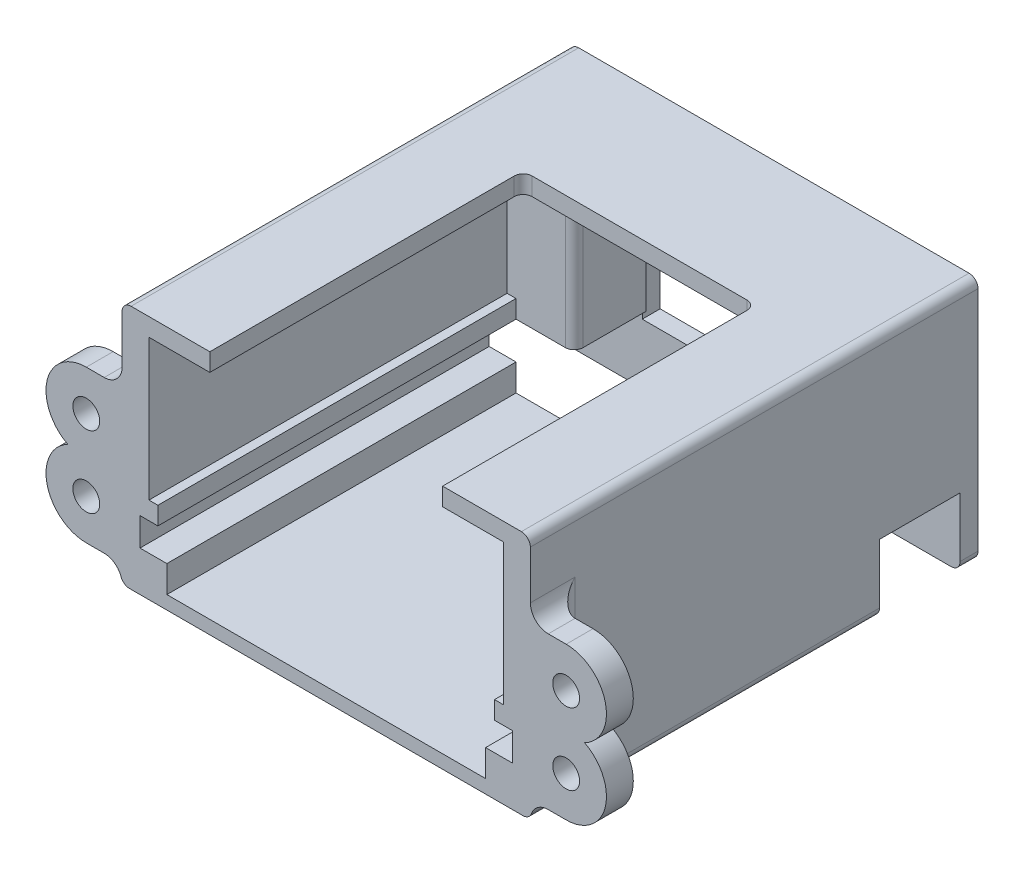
ISO-10303-21;
HEADER;
FILE_DESCRIPTION(('STEP AP214'),'2;1');
FILE_NAME('part.step','',(''),(''),'','','');
FILE_SCHEMA(('AUTOMOTIVE_DESIGN { 1 0 10303 214 1 1 1 1 }'));
ENDSEC;
DATA;
#1=APPLICATION_CONTEXT('core data for automotive mechanical design processes');
#2=APPLICATION_PROTOCOL_DEFINITION('international standard','automotive_design',2000,#1);
#3=PRODUCT_CONTEXT('',#1,'mechanical');
#4=PRODUCT('Part','Part','',(#3));
#5=PRODUCT_RELATED_PRODUCT_CATEGORY('part','',(#4));
#6=PRODUCT_DEFINITION_FORMATION('','',#4);
#7=PRODUCT_DEFINITION_CONTEXT('part definition',#1,'design');
#8=PRODUCT_DEFINITION('design','',#6,#7);
#9=PRODUCT_DEFINITION_SHAPE('','',#8);
#10=(LENGTH_UNIT() NAMED_UNIT(*) SI_UNIT(.MILLI.,.METRE.));
#11=(NAMED_UNIT(*) PLANE_ANGLE_UNIT() SI_UNIT($,.RADIAN.));
#12=(NAMED_UNIT(*) SI_UNIT($,.STERADIAN.) SOLID_ANGLE_UNIT());
#13=UNCERTAINTY_MEASURE_WITH_UNIT(LENGTH_MEASURE(1.E-05),#10,'distance_accuracy_value','');
#14=(GEOMETRIC_REPRESENTATION_CONTEXT(3) GLOBAL_UNCERTAINTY_ASSIGNED_CONTEXT((#13)) GLOBAL_UNIT_ASSIGNED_CONTEXT((#10,
#11,#12)) REPRESENTATION_CONTEXT('',''));
#15=CARTESIAN_POINT('',(0.,0.,0.));
#16=DIRECTION('',(0.,0.,1.));
#17=DIRECTION('',(1.,0.,0.));
#18=AXIS2_PLACEMENT_3D('',#15,#16,#17);
#19=CARTESIAN_POINT('',(0.,0.,-48.));
#20=DIRECTION('',(0.,0.,-1.));
#21=DIRECTION('',(-1.,0.,0.));
#22=AXIS2_PLACEMENT_3D('',#19,#20,#21);
#23=PLANE('',#22);
#24=DIRECTION('',(0.,-1.,0.));
#25=VECTOR('',#24,1.);
#26=CARTESIAN_POINT('',(-22.8,20.4543271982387,-48.));
#27=LINE('',#26,#25);
#28=CARTESIAN_POINT('',(-22.8,6.1408056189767,-48.));
#29=VERTEX_POINT('',#28);
#30=CARTESIAN_POINT('',(-22.8,-0.5,-48.));
#31=VERTEX_POINT('',#30);
#32=EDGE_CURVE('E673',#29,#31,#27,.T.);
#33=ORIENTED_EDGE('',*,*,#32,.T.);
#34=CARTESIAN_POINT('',(-21.8,-0.5,-48.));
#35=DIRECTION('',(0.,0.,-1.));
#36=DIRECTION('',(-1.,0.,0.));
#37=AXIS2_PLACEMENT_3D('',#34,#35,#36);
#38=CIRCLE('',#37,1.);
#39=CARTESIAN_POINT('',(-21.8,-1.5,-48.));
#40=VERTEX_POINT('',#39);
#41=EDGE_CURVE('E68',#31,#40,#38,.F.);
#42=ORIENTED_EDGE('',*,*,#41,.T.);
#43=DIRECTION('',(1.,0.,0.));
#44=VECTOR('',#43,1.);
#45=CARTESIAN_POINT('',(0.,-1.5,-48.));
#46=LINE('',#45,#44);
#47=CARTESIAN_POINT('',(-11.67,-1.5,-48.));
#48=VERTEX_POINT('',#47);
#49=EDGE_CURVE('E664',#40,#48,#46,.T.);
#50=ORIENTED_EDGE('',*,*,#49,.T.);
#51=DIRECTION('',(0.,-1.,0.));
#52=VECTOR('',#51,1.);
#53=CARTESIAN_POINT('',(-11.67,20.4543271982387,-48.));
#54=LINE('',#53,#52);
#55=CARTESIAN_POINT('',(-11.67,0.,-48.));
#56=VERTEX_POINT('',#55);
#57=EDGE_CURVE('E678',#56,#48,#54,.T.);
#58=ORIENTED_EDGE('',*,*,#57,.F.);
#59=DIRECTION('',(1.,0.,0.));
#60=VECTOR('',#59,1.);
#61=CARTESIAN_POINT('',(-17.8,0.,-48.));
#62=LINE('',#61,#60);
#63=CARTESIAN_POINT('',(11.67,0.,-48.));
#64=VERTEX_POINT('',#63);
#65=EDGE_CURVE('E770',#56,#64,#62,.T.);
#66=ORIENTED_EDGE('',*,*,#65,.T.);
#67=DIRECTION('',(0.,-1.,0.));
#68=VECTOR('',#67,1.);
#69=CARTESIAN_POINT('',(11.67,20.4543271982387,-48.));
#70=LINE('',#69,#68);
#71=CARTESIAN_POINT('',(11.67,-1.5,-48.));
#72=VERTEX_POINT('',#71);
#73=EDGE_CURVE('E700',#64,#72,#70,.T.);
#74=ORIENTED_EDGE('',*,*,#73,.T.);
#75=DIRECTION('',(1.,0.,0.));
#76=VECTOR('',#75,1.);
#77=CARTESIAN_POINT('',(0.,-1.5,-48.));
#78=LINE('',#77,#76);
#79=CARTESIAN_POINT('',(21.8,-1.5,-48.));
#80=VERTEX_POINT('',#79);
#81=EDGE_CURVE('E684',#72,#80,#78,.T.);
#82=ORIENTED_EDGE('',*,*,#81,.T.);
#83=CARTESIAN_POINT('',(21.8,-0.499999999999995,-48.));
#84=DIRECTION('',(0.,0.,-1.));
#85=DIRECTION('',(-1.,0.,0.));
#86=AXIS2_PLACEMENT_3D('',#83,#84,#85);
#87=CIRCLE('',#86,1.);
#88=CARTESIAN_POINT('',(22.8,-0.499999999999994,-48.));
#89=VERTEX_POINT('',#88);
#90=EDGE_CURVE('E1132',#80,#89,#87,.F.);
#91=ORIENTED_EDGE('',*,*,#90,.T.);
#92=DIRECTION('',(0.,-1.,0.));
#93=VECTOR('',#92,1.);
#94=CARTESIAN_POINT('',(22.8,20.4543271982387,-48.));
#95=LINE('',#94,#93);
#96=CARTESIAN_POINT('',(22.8,6.1408056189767,-48.));
#97=VERTEX_POINT('',#96);
#98=EDGE_CURVE('E697',#97,#89,#95,.T.);
#99=ORIENTED_EDGE('',*,*,#98,.F.);
#100=DIRECTION('',(-1.,0.,0.));
#101=VECTOR('',#100,1.);
#102=CARTESIAN_POINT('',(18.8,6.14080561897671,-48.));
#103=LINE('',#102,#101);
#104=CARTESIAN_POINT('',(12.7,6.1408056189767,-48.));
#105=VERTEX_POINT('',#104);
#106=EDGE_CURVE('E764',#97,#105,#103,.T.);
#107=ORIENTED_EDGE('',*,*,#106,.T.);
#108=DIRECTION('',(0.,1.,0.));
#109=VECTOR('',#108,1.);
#110=CARTESIAN_POINT('',(12.7,0.,-48.));
#111=LINE('',#110,#109);
#112=CARTESIAN_POINT('',(12.7,5.19080561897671,-48.));
#113=VERTEX_POINT('',#112);
#114=EDGE_CURVE('E735',#113,#105,#111,.T.);
#115=ORIENTED_EDGE('',*,*,#114,.F.);
#116=DIRECTION('',(1.,0.,0.));
#117=VECTOR('',#116,1.);
#118=CARTESIAN_POINT('',(0.,5.19080561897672,-48.));
#119=LINE('',#118,#117);
#120=CARTESIAN_POINT('',(-12.7,5.19080561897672,-48.));
#121=VERTEX_POINT('',#120);
#122=EDGE_CURVE('E738',#121,#113,#119,.T.);
#123=ORIENTED_EDGE('',*,*,#122,.F.);
#124=DIRECTION('',(0.,1.,0.));
#125=VECTOR('',#124,1.);
#126=CARTESIAN_POINT('',(-12.7,0.,-48.));
#127=LINE('',#126,#125);
#128=CARTESIAN_POINT('',(-12.7,6.1408056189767,-48.));
#129=VERTEX_POINT('',#128);
#130=EDGE_CURVE('E761',#121,#129,#127,.T.);
#131=ORIENTED_EDGE('',*,*,#130,.T.);
#132=DIRECTION('',(-1.,0.,0.));
#133=VECTOR('',#132,1.);
#134=CARTESIAN_POINT('',(-18.8,6.1408056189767,-48.));
#135=LINE('',#134,#133);
#136=EDGE_CURVE('E768',#129,#29,#135,.T.);
#137=ORIENTED_EDGE('',*,*,#136,.T.);
#138=EDGE_LOOP('',(#33,#42,#50,#58,#66,#74,#82,#91,#99,#107,#115,#123,#131,#137));
#139=FACE_BOUND('',#138,.T.);
#140=ADVANCED_FACE('F43',(#139),#23,.F.);
#141=CARTESIAN_POINT('',(-18.8,8.1408056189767,-50.));
#142=DIRECTION('',(-1.,0.,0.));
#143=DIRECTION('',(0.,-1.,0.));
#144=AXIS2_PLACEMENT_3D('',#141,#142,#143);
#145=PLANE('',#144);
#146=DIRECTION('',(0.,-1.,0.));
#147=VECTOR('',#146,1.);
#148=CARTESIAN_POINT('',(-18.8,8.1408056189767,-40.));
#149=LINE('',#148,#147);
#150=CARTESIAN_POINT('',(-18.8,8.1408056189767,-40.));
#151=VERTEX_POINT('',#150);
#152=CARTESIAN_POINT('',(-18.8,6.1408056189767,-40.));
#153=VERTEX_POINT('',#152);
#154=EDGE_CURVE('E655',#151,#153,#149,.T.);
#155=ORIENTED_EDGE('',*,*,#154,.F.);
#156=DIRECTION('',(0.,0.,1.));
#157=VECTOR('',#156,1.);
#158=CARTESIAN_POINT('',(-18.8,8.1408056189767,-50.));
#159=LINE('',#158,#157);
#160=CARTESIAN_POINT('',(-18.8,8.1408056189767,0.));
#161=VERTEX_POINT('',#160);
#162=EDGE_CURVE('E860',#151,#161,#159,.T.);
#163=ORIENTED_EDGE('',*,*,#162,.T.);
#164=DIRECTION('',(0.,-1.,0.));
#165=VECTOR('',#164,1.);
#166=CARTESIAN_POINT('',(-18.8,8.1408056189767,0.));
#167=LINE('',#166,#165);
#168=CARTESIAN_POINT('',(-18.8,6.1408056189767,0.));
#169=VERTEX_POINT('',#168);
#170=EDGE_CURVE('E823',#161,#169,#167,.T.);
#171=ORIENTED_EDGE('',*,*,#170,.T.);
#172=DIRECTION('',(0.,0.,1.));
#173=VECTOR('',#172,1.);
#174=CARTESIAN_POINT('',(-18.8,6.1408056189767,-50.));
#175=LINE('',#174,#173);
#176=EDGE_CURVE('E858',#153,#169,#175,.T.);
#177=ORIENTED_EDGE('',*,*,#176,.F.);
#178=EDGE_LOOP('',(#155,#163,#171,#177));
#179=FACE_BOUND('',#178,.T.);
#180=ADVANCED_FACE('F1012',(#179),#145,.F.);
#181=CARTESIAN_POINT('',(-19.8,8.1408056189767,-50.));
#182=DIRECTION('',(0.,-1.,0.));
#183=DIRECTION('',(0.,0.,-1.));
#184=AXIS2_PLACEMENT_3D('',#181,#182,#183);
#185=PLANE('',#184);
#186=DIRECTION('',(1.,0.,0.));
#187=VECTOR('',#186,1.);
#188=CARTESIAN_POINT('',(-19.8,8.1408056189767,-40.));
#189=LINE('',#188,#187);
#190=CARTESIAN_POINT('',(-19.8,8.1408056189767,-40.));
#191=VERTEX_POINT('',#190);
#192=EDGE_CURVE('E652',#191,#151,#189,.T.);
#193=ORIENTED_EDGE('',*,*,#192,.F.);
#194=DIRECTION('',(0.,0.,1.));
#195=VECTOR('',#194,1.);
#196=CARTESIAN_POINT('',(-19.8,8.1408056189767,-50.));
#197=LINE('',#196,#195);
#198=CARTESIAN_POINT('',(-19.8,8.1408056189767,0.));
#199=VERTEX_POINT('',#198);
#200=EDGE_CURVE('E862',#191,#199,#197,.T.);
#201=ORIENTED_EDGE('',*,*,#200,.T.);
#202=DIRECTION('',(1.,0.,0.));
#203=VECTOR('',#202,1.);
#204=CARTESIAN_POINT('',(-19.8,8.1408056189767,0.));
#205=LINE('',#204,#203);
#206=EDGE_CURVE('E820',#199,#161,#205,.T.);
#207=ORIENTED_EDGE('',*,*,#206,.T.);
#208=ORIENTED_EDGE('',*,*,#162,.F.);
#209=EDGE_LOOP('',(#193,#201,#207,#208));
#210=FACE_BOUND('',#209,.T.);
#211=ADVANCED_FACE('F1020',(#210),#185,.F.);
#212=CARTESIAN_POINT('',(-19.8,23.8908056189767,-50.));
#213=DIRECTION('',(-1.,0.,0.));
#214=DIRECTION('',(0.,-1.,0.));
#215=AXIS2_PLACEMENT_3D('',#212,#213,#214);
#216=PLANE('',#215);
#217=DIRECTION('',(0.,-1.,0.));
#218=VECTOR('',#217,1.);
#219=CARTESIAN_POINT('',(-19.8,34.8566617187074,-40.));
#220=LINE('',#219,#218);
#221=CARTESIAN_POINT('',(-19.8,23.8908056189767,-40.));
#222=VERTEX_POINT('',#221);
#223=EDGE_CURVE('E640',#222,#191,#220,.T.);
#224=ORIENTED_EDGE('',*,*,#223,.F.);
#225=DIRECTION('',(0.,0.,1.));
#226=VECTOR('',#225,1.);
#227=CARTESIAN_POINT('',(-19.8,23.8908056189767,-50.));
#228=LINE('',#227,#226);
#229=CARTESIAN_POINT('',(-19.8,23.8908056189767,0.));
#230=VERTEX_POINT('',#229);
#231=EDGE_CURVE('E864',#222,#230,#228,.T.);
#232=ORIENTED_EDGE('',*,*,#231,.T.);
#233=DIRECTION('',(0.,-1.,0.));
#234=VECTOR('',#233,1.);
#235=CARTESIAN_POINT('',(-19.8,23.8908056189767,0.));
#236=LINE('',#235,#234);
#237=EDGE_CURVE('E817',#230,#199,#236,.T.);
#238=ORIENTED_EDGE('',*,*,#237,.T.);
#239=ORIENTED_EDGE('',*,*,#200,.F.);
#240=EDGE_LOOP('',(#224,#232,#238,#239));
#241=FACE_BOUND('',#240,.T.);
#242=ADVANCED_FACE('F1636',(#241),#216,.F.);
#243=CARTESIAN_POINT('',(-19.8,23.8908056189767,-50.));
#244=DIRECTION('',(0.,1.,0.));
#245=DIRECTION('',(-1.,0.,0.));
#246=AXIS2_PLACEMENT_3D('',#243,#244,#245);
#247=PLANE('',#246);
#248=DIRECTION('',(-1.,0.,0.));
#249=VECTOR('',#248,1.);
#250=CARTESIAN_POINT('',(-19.8,23.8908056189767,-48.));
#251=LINE('',#250,#249);
#252=CARTESIAN_POINT('',(12.3,23.8908056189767,-48.));
#253=VERTEX_POINT('',#252);
#254=CARTESIAN_POINT('',(-12.3,23.8908056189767,-48.));
#255=VERTEX_POINT('',#254);
#256=EDGE_CURVE('E766',#253,#255,#251,.T.);
#257=ORIENTED_EDGE('',*,*,#256,.F.);
#258=DIRECTION('',(0.,0.,-1.));
#259=VECTOR('',#258,1.);
#260=CARTESIAN_POINT('',(12.3,23.8908056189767,0.));
#261=LINE('',#260,#259);
#262=CARTESIAN_POINT('',(12.3,23.8908056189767,-41.));
#263=VERTEX_POINT('',#262);
#264=EDGE_CURVE('E572',#263,#253,#261,.T.);
#265=ORIENTED_EDGE('',*,*,#264,.F.);
#266=CARTESIAN_POINT('',(13.3,23.8908056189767,-41.));
#267=DIRECTION('',(0.,1.,0.));
#268=DIRECTION('',(-1.,0.,0.));
#269=AXIS2_PLACEMENT_3D('',#266,#267,#268);
#270=CIRCLE('',#269,1.);
#271=CARTESIAN_POINT('',(13.3,23.8908056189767,-40.));
#272=VERTEX_POINT('',#271);
#273=EDGE_CURVE('E597',#272,#263,#270,.F.);
#274=ORIENTED_EDGE('',*,*,#273,.F.);
#275=DIRECTION('',(-1.,0.,0.));
#276=VECTOR('',#275,1.);
#277=CARTESIAN_POINT('',(0.,23.8908056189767,-40.));
#278=LINE('',#277,#276);
#279=CARTESIAN_POINT('',(19.8,23.8908056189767,-40.));
#280=VERTEX_POINT('',#279);
#281=EDGE_CURVE('E577',#280,#272,#278,.T.);
#282=ORIENTED_EDGE('',*,*,#281,.F.);
#283=DIRECTION('',(0.,0.,1.));
#284=VECTOR('',#283,1.);
#285=CARTESIAN_POINT('',(19.8,23.8908056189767,-50.));
#286=LINE('',#285,#284);
#287=CARTESIAN_POINT('',(19.8,23.8908056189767,0.));
#288=VERTEX_POINT('',#287);
#289=EDGE_CURVE('E866',#280,#288,#286,.T.);
#290=ORIENTED_EDGE('',*,*,#289,.T.);
#291=DIRECTION('',(-1.,0.,0.));
#292=VECTOR('',#291,1.);
#293=CARTESIAN_POINT('',(-19.8,23.8908056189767,0.));
#294=LINE('',#293,#292);
#295=CARTESIAN_POINT('',(13.,23.8908056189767,0.));
#296=VERTEX_POINT('',#295);
#297=EDGE_CURVE('E814',#288,#296,#294,.T.);
#298=ORIENTED_EDGE('',*,*,#297,.T.);
#299=DIRECTION('',(0.,0.,1.));
#300=VECTOR('',#299,1.);
#301=CARTESIAN_POINT('',(13.,23.8908056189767,0.));
#302=LINE('',#301,#300);
#303=CARTESIAN_POINT('',(13.,23.8908056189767,-34.));
#304=VERTEX_POINT('',#303);
#305=EDGE_CURVE('E773',#304,#296,#302,.T.);
#306=ORIENTED_EDGE('',*,*,#305,.F.);
#307=CARTESIAN_POINT('',(12.,23.8908056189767,-34.));
#308=DIRECTION('',(0.,1.,0.));
#309=DIRECTION('',(-1.,0.,0.));
#310=AXIS2_PLACEMENT_3D('',#307,#308,#309);
#311=CIRCLE('',#310,1.);
#312=CARTESIAN_POINT('',(12.,23.8908056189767,-35.));
#313=VERTEX_POINT('',#312);
#314=EDGE_CURVE('E1137',#304,#313,#311,.T.);
#315=ORIENTED_EDGE('',*,*,#314,.T.);
#316=DIRECTION('',(-1.,0.,0.));
#317=VECTOR('',#316,1.);
#318=CARTESIAN_POINT('',(0.,23.8908056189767,-35.));
#319=LINE('',#318,#317);
#320=CARTESIAN_POINT('',(-12.,23.8908056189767,-35.));
#321=VERTEX_POINT('',#320);
#322=EDGE_CURVE('E785',#313,#321,#319,.T.);
#323=ORIENTED_EDGE('',*,*,#322,.T.);
#324=CARTESIAN_POINT('',(-12.,23.8908056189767,-34.));
#325=DIRECTION('',(0.,1.,0.));
#326=DIRECTION('',(-1.,0.,0.));
#327=AXIS2_PLACEMENT_3D('',#324,#325,#326);
#328=CIRCLE('',#327,1.);
#329=CARTESIAN_POINT('',(-13.,23.8908056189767,-34.));
#330=VERTEX_POINT('',#329);
#331=EDGE_CURVE('E11',#321,#330,#328,.T.);
#332=ORIENTED_EDGE('',*,*,#331,.T.);
#333=DIRECTION('',(0.,0.,1.));
#334=VECTOR('',#333,1.);
#335=CARTESIAN_POINT('',(-13.,23.8908056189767,0.));
#336=LINE('',#335,#334);
#337=CARTESIAN_POINT('',(-13.,23.8908056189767,0.));
#338=VERTEX_POINT('',#337);
#339=EDGE_CURVE('E784',#330,#338,#336,.T.);
#340=ORIENTED_EDGE('',*,*,#339,.T.);
#341=EDGE_CURVE('E813',#338,#230,#294,.T.);
#342=ORIENTED_EDGE('',*,*,#341,.T.);
#343=ORIENTED_EDGE('',*,*,#231,.F.);
#344=DIRECTION('',(1.,0.,0.));
#345=VECTOR('',#344,1.);
#346=CARTESIAN_POINT('',(0.,23.8908056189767,-40.));
#347=LINE('',#346,#345);
#348=CARTESIAN_POINT('',(-13.3,23.8908056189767,-40.));
#349=VERTEX_POINT('',#348);
#350=EDGE_CURVE('E616',#222,#349,#347,.T.);
#351=ORIENTED_EDGE('',*,*,#350,.T.);
#352=CARTESIAN_POINT('',(-13.3,23.8908056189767,-41.));
#353=DIRECTION('',(0.,1.,0.));
#354=DIRECTION('',(-1.,0.,0.));
#355=AXIS2_PLACEMENT_3D('',#352,#353,#354);
#356=CIRCLE('',#355,1.);
#357=CARTESIAN_POINT('',(-12.3,23.8908056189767,-41.));
#358=VERTEX_POINT('',#357);
#359=EDGE_CURVE('E638',#358,#349,#356,.F.);
#360=ORIENTED_EDGE('',*,*,#359,.F.);
#361=DIRECTION('',(0.,0.,-1.));
#362=VECTOR('',#361,1.);
#363=CARTESIAN_POINT('',(-12.3,23.8908056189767,0.));
#364=LINE('',#363,#362);
#365=EDGE_CURVE('E618',#358,#255,#364,.T.);
#366=ORIENTED_EDGE('',*,*,#365,.T.);
#367=EDGE_LOOP('',(#257,#265,#274,#282,#290,#298,#306,#315,#323,#332,#340,#342,#343,#351,#360,#366));
#368=FACE_BOUND('',#367,.T.);
#369=ADVANCED_FACE('F1069',(#368),#247,.F.);
#370=CARTESIAN_POINT('',(-17.8,0.,-50.));
#371=DIRECTION('',(0.,-1.,0.));
#372=DIRECTION('',(0.,0.,-1.));
#373=AXIS2_PLACEMENT_3D('',#370,#371,#372);
#374=PLANE('',#373);
#375=DIRECTION('',(0.,0.,-1.));
#376=VECTOR('',#375,1.);
#377=CARTESIAN_POINT('',(-11.67,0.,-50.));
#378=LINE('',#377,#376);
#379=CARTESIAN_POINT('',(-11.67,0.,-39.));
#380=VERTEX_POINT('',#379);
#381=EDGE_CURVE('E709',#380,#56,#378,.T.);
#382=ORIENTED_EDGE('',*,*,#381,.F.);
#383=DIRECTION('',(1.,0.,0.));
#384=VECTOR('',#383,1.);
#385=CARTESIAN_POINT('',(-17.8,0.,-39.));
#386=LINE('',#385,#384);
#387=CARTESIAN_POINT('',(-17.8,0.,-39.));
#388=VERTEX_POINT('',#387);
#389=EDGE_CURVE('E717',#388,#380,#386,.T.);
#390=ORIENTED_EDGE('',*,*,#389,.F.);
#391=DIRECTION('',(0.,0.,1.));
#392=VECTOR('',#391,1.);
#393=CARTESIAN_POINT('',(-17.8,0.,-50.));
#394=LINE('',#393,#392);
#395=CARTESIAN_POINT('',(-17.8,0.,0.));
#396=VERTEX_POINT('',#395);
#397=EDGE_CURVE('E850',#388,#396,#394,.T.);
#398=ORIENTED_EDGE('',*,*,#397,.T.);
#399=DIRECTION('',(1.,0.,0.));
#400=VECTOR('',#399,1.);
#401=CARTESIAN_POINT('',(-17.8,0.,0.));
#402=LINE('',#401,#400);
#403=CARTESIAN_POINT('',(17.8,0.,0.));
#404=VERTEX_POINT('',#403);
#405=EDGE_CURVE('E838',#396,#404,#402,.T.);
#406=ORIENTED_EDGE('',*,*,#405,.T.);
#407=DIRECTION('',(0.,0.,1.));
#408=VECTOR('',#407,1.);
#409=CARTESIAN_POINT('',(17.8,0.,-50.));
#410=LINE('',#409,#408);
#411=CARTESIAN_POINT('',(17.8,0.,-39.));
#412=VERTEX_POINT('',#411);
#413=EDGE_CURVE('E848',#412,#404,#410,.T.);
#414=ORIENTED_EDGE('',*,*,#413,.F.);
#415=DIRECTION('',(-1.,0.,0.));
#416=VECTOR('',#415,1.);
#417=CARTESIAN_POINT('',(-17.8,0.,-39.));
#418=LINE('',#417,#416);
#419=CARTESIAN_POINT('',(11.67,0.,-39.));
#420=VERTEX_POINT('',#419);
#421=EDGE_CURVE('E728',#412,#420,#418,.T.);
#422=ORIENTED_EDGE('',*,*,#421,.T.);
#423=DIRECTION('',(0.,0.,-1.));
#424=VECTOR('',#423,1.);
#425=CARTESIAN_POINT('',(11.67,0.,-50.));
#426=LINE('',#425,#424);
#427=EDGE_CURVE('E670',#420,#64,#426,.T.);
#428=ORIENTED_EDGE('',*,*,#427,.T.);
#429=ORIENTED_EDGE('',*,*,#65,.F.);
#430=EDGE_LOOP('',(#382,#390,#398,#406,#414,#422,#428,#429));
#431=FACE_BOUND('',#430,.T.);
#432=ADVANCED_FACE('F1293',(#431),#374,.F.);
#433=CARTESIAN_POINT('',(-17.8,3.,-50.));
#434=DIRECTION('',(-1.,0.,0.));
#435=DIRECTION('',(0.,0.,1.));
#436=AXIS2_PLACEMENT_3D('',#433,#434,#435);
#437=PLANE('',#436);
#438=DIRECTION('',(0.,-1.,0.));
#439=VECTOR('',#438,1.);
#440=CARTESIAN_POINT('',(-17.8,3.,-39.));
#441=LINE('',#440,#439);
#442=CARTESIAN_POINT('',(-17.8,3.,-39.));
#443=VERTEX_POINT('',#442);
#444=EDGE_CURVE('E715',#443,#388,#441,.T.);
#445=ORIENTED_EDGE('',*,*,#444,.F.);
#446=DIRECTION('',(0.,0.,1.));
#447=VECTOR('',#446,1.);
#448=CARTESIAN_POINT('',(-17.8,3.,-50.));
#449=LINE('',#448,#447);
#450=CARTESIAN_POINT('',(-17.8,3.,0.));
#451=VERTEX_POINT('',#450);
#452=EDGE_CURVE('E852',#443,#451,#449,.T.);
#453=ORIENTED_EDGE('',*,*,#452,.T.);
#454=DIRECTION('',(0.,-1.,0.));
#455=VECTOR('',#454,1.);
#456=CARTESIAN_POINT('',(-17.8,3.,0.));
#457=LINE('',#456,#455);
#458=EDGE_CURVE('E835',#451,#396,#457,.T.);
#459=ORIENTED_EDGE('',*,*,#458,.T.);
#460=ORIENTED_EDGE('',*,*,#397,.F.);
#461=EDGE_LOOP('',(#445,#453,#459,#460));
#462=FACE_BOUND('',#461,.T.);
#463=ADVANCED_FACE('F1291',(#462),#437,.F.);
#464=CARTESIAN_POINT('',(-20.8,3.,-50.));
#465=DIRECTION('',(0.,-1.,0.));
#466=DIRECTION('',(0.,0.,-1.));
#467=AXIS2_PLACEMENT_3D('',#464,#465,#466);
#468=PLANE('',#467);
#469=DIRECTION('',(1.,0.,0.));
#470=VECTOR('',#469,1.);
#471=CARTESIAN_POINT('',(-20.8,3.,-39.));
#472=LINE('',#471,#470);
#473=CARTESIAN_POINT('',(-20.8,3.,-39.));
#474=VERTEX_POINT('',#473);
#475=EDGE_CURVE('E713',#474,#443,#472,.T.);
#476=ORIENTED_EDGE('',*,*,#475,.F.);
#477=DIRECTION('',(0.,0.,1.));
#478=VECTOR('',#477,1.);
#479=CARTESIAN_POINT('',(-20.8,3.,-50.));
#480=LINE('',#479,#478);
#481=CARTESIAN_POINT('',(-20.8,3.,0.));
#482=VERTEX_POINT('',#481);
#483=EDGE_CURVE('E854',#474,#482,#480,.T.);
#484=ORIENTED_EDGE('',*,*,#483,.T.);
#485=DIRECTION('',(1.,0.,0.));
#486=VECTOR('',#485,1.);
#487=CARTESIAN_POINT('',(-20.8,3.,0.));
#488=LINE('',#487,#486);
#489=EDGE_CURVE('E832',#482,#451,#488,.T.);
#490=ORIENTED_EDGE('',*,*,#489,.T.);
#491=ORIENTED_EDGE('',*,*,#452,.F.);
#492=EDGE_LOOP('',(#476,#484,#490,#491));
#493=FACE_BOUND('',#492,.T.);
#494=ADVANCED_FACE('F1287',(#493),#468,.F.);
#495=CARTESIAN_POINT('',(-20.8,6.1408056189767,-50.));
#496=DIRECTION('',(-1.,0.,0.));
#497=DIRECTION('',(0.,0.,1.));
#498=AXIS2_PLACEMENT_3D('',#495,#496,#497);
#499=PLANE('',#498);
#500=DIRECTION('',(0.,-1.,0.));
#501=VECTOR('',#500,1.);
#502=CARTESIAN_POINT('',(-20.8,6.1408056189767,-39.));
#503=LINE('',#502,#501);
#504=CARTESIAN_POINT('',(-20.8,6.1408056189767,-39.));
#505=VERTEX_POINT('',#504);
#506=EDGE_CURVE('E711',#505,#474,#503,.T.);
#507=ORIENTED_EDGE('',*,*,#506,.F.);
#508=DIRECTION('',(0.,0.,1.));
#509=VECTOR('',#508,1.);
#510=CARTESIAN_POINT('',(-20.8,6.1408056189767,-50.));
#511=LINE('',#510,#509);
#512=CARTESIAN_POINT('',(-20.8,6.1408056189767,0.));
#513=VERTEX_POINT('',#512);
#514=EDGE_CURVE('E856',#505,#513,#511,.T.);
#515=ORIENTED_EDGE('',*,*,#514,.T.);
#516=DIRECTION('',(0.,-1.,0.));
#517=VECTOR('',#516,1.);
#518=CARTESIAN_POINT('',(-20.8,6.1408056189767,0.));
#519=LINE('',#518,#517);
#520=EDGE_CURVE('E829',#513,#482,#519,.T.);
#521=ORIENTED_EDGE('',*,*,#520,.T.);
#522=ORIENTED_EDGE('',*,*,#483,.F.);
#523=EDGE_LOOP('',(#507,#515,#521,#522));
#524=FACE_BOUND('',#523,.T.);
#525=ADVANCED_FACE('F1275',(#524),#499,.F.);
#526=CARTESIAN_POINT('',(20.8,3.00000000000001,-50.));
#527=DIRECTION('',(0.,-1.,0.));
#528=DIRECTION('',(0.,0.,-1.));
#529=AXIS2_PLACEMENT_3D('',#526,#527,#528);
#530=PLANE('',#529);
#531=DIRECTION('',(0.,0.,1.));
#532=VECTOR('',#531,1.);
#533=CARTESIAN_POINT('',(20.8,3.00000000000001,-50.));
#534=LINE('',#533,#532);
#535=CARTESIAN_POINT('',(20.8,3.00000000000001,-39.));
#536=VERTEX_POINT('',#535);
#537=CARTESIAN_POINT('',(20.8,3.00000000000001,0.));
#538=VERTEX_POINT('',#537);
#539=EDGE_CURVE('E844',#536,#538,#534,.T.);
#540=ORIENTED_EDGE('',*,*,#539,.F.);
#541=DIRECTION('',(-1.,0.,0.));
#542=VECTOR('',#541,1.);
#543=CARTESIAN_POINT('',(20.8,3.00000000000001,-39.));
#544=LINE('',#543,#542);
#545=CARTESIAN_POINT('',(17.8,3.00000000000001,-39.));
#546=VERTEX_POINT('',#545);
#547=EDGE_CURVE('E722',#536,#546,#544,.T.);
#548=ORIENTED_EDGE('',*,*,#547,.T.);
#549=DIRECTION('',(0.,0.,1.));
#550=VECTOR('',#549,1.);
#551=CARTESIAN_POINT('',(17.8,3.00000000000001,-50.));
#552=LINE('',#551,#550);
#553=CARTESIAN_POINT('',(17.8,3.00000000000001,0.));
#554=VERTEX_POINT('',#553);
#555=EDGE_CURVE('E845',#546,#554,#552,.T.);
#556=ORIENTED_EDGE('',*,*,#555,.T.);
#557=DIRECTION('',(1.,0.,0.));
#558=VECTOR('',#557,1.);
#559=CARTESIAN_POINT('',(20.8,3.00000000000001,0.));
#560=LINE('',#559,#558);
#561=EDGE_CURVE('E795',#554,#538,#560,.T.);
#562=ORIENTED_EDGE('',*,*,#561,.T.);
#563=EDGE_LOOP('',(#540,#548,#556,#562));
#564=FACE_BOUND('',#563,.T.);
#565=ADVANCED_FACE('F1321',(#564),#530,.F.);
#566=CARTESIAN_POINT('',(17.8,3.00000000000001,-50.));
#567=DIRECTION('',(1.,0.,0.));
#568=DIRECTION('',(0.,0.,-1.));
#569=AXIS2_PLACEMENT_3D('',#566,#567,#568);
#570=PLANE('',#569);
#571=ORIENTED_EDGE('',*,*,#555,.F.);
#572=DIRECTION('',(0.,-1.,0.));
#573=VECTOR('',#572,1.);
#574=CARTESIAN_POINT('',(17.8,3.00000000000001,-39.));
#575=LINE('',#574,#573);
#576=EDGE_CURVE('E725',#546,#412,#575,.T.);
#577=ORIENTED_EDGE('',*,*,#576,.T.);
#578=ORIENTED_EDGE('',*,*,#413,.T.);
#579=DIRECTION('',(0.,1.,0.));
#580=VECTOR('',#579,1.);
#581=CARTESIAN_POINT('',(17.8,3.00000000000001,0.));
#582=LINE('',#581,#580);
#583=EDGE_CURVE('E841',#404,#554,#582,.T.);
#584=ORIENTED_EDGE('',*,*,#583,.T.);
#585=EDGE_LOOP('',(#571,#577,#578,#584));
#586=FACE_BOUND('',#585,.T.);
#587=ADVANCED_FACE('F1317',(#586),#570,.F.);
#588=CARTESIAN_POINT('',(-18.8,6.1408056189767,-50.));
#589=DIRECTION('',(0.,1.,0.));
#590=DIRECTION('',(0.,0.,1.));
#591=AXIS2_PLACEMENT_3D('',#588,#589,#590);
#592=PLANE('',#591);
#593=ORIENTED_EDGE('',*,*,#136,.F.);
#594=DIRECTION('',(1.,0.,0.));
#595=VECTOR('',#594,1.);
#596=CARTESIAN_POINT('',(0.,6.1408056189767,-48.));
#597=LINE('',#596,#595);
#598=CARTESIAN_POINT('',(-12.3,6.1408056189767,-48.));
#599=VERTEX_POINT('',#598);
#600=EDGE_CURVE('E632',#129,#599,#597,.T.);
#601=ORIENTED_EDGE('',*,*,#600,.T.);
#602=DIRECTION('',(0.,0.,-1.));
#603=VECTOR('',#602,1.);
#604=CARTESIAN_POINT('',(-12.3,6.1408056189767,0.));
#605=LINE('',#604,#603);
#606=CARTESIAN_POINT('',(-12.3,6.1408056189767,-41.));
#607=VERTEX_POINT('',#606);
#608=EDGE_CURVE('E624',#607,#599,#605,.T.);
#609=ORIENTED_EDGE('',*,*,#608,.F.);
#610=CARTESIAN_POINT('',(-13.3,6.1408056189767,-41.));
#611=DIRECTION('',(0.,-1.,0.));
#612=DIRECTION('',(0.,0.,-1.));
#613=AXIS2_PLACEMENT_3D('',#610,#611,#612);
#614=CIRCLE('',#613,1.);
#615=CARTESIAN_POINT('',(-13.3,6.1408056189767,-40.));
#616=VERTEX_POINT('',#615);
#617=EDGE_CURVE('E627',#607,#616,#614,.T.);
#618=ORIENTED_EDGE('',*,*,#617,.T.);
#619=DIRECTION('',(1.,0.,0.));
#620=VECTOR('',#619,1.);
#621=CARTESIAN_POINT('',(0.,6.1408056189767,-40.));
#622=LINE('',#621,#620);
#623=EDGE_CURVE('E630',#153,#616,#622,.T.);
#624=ORIENTED_EDGE('',*,*,#623,.F.);
#625=ORIENTED_EDGE('',*,*,#176,.T.);
#626=DIRECTION('',(-1.,0.,0.));
#627=VECTOR('',#626,1.);
#628=CARTESIAN_POINT('',(-18.8,6.1408056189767,0.));
#629=LINE('',#628,#627);
#630=EDGE_CURVE('E826',#169,#513,#629,.T.);
#631=ORIENTED_EDGE('',*,*,#630,.T.);
#632=ORIENTED_EDGE('',*,*,#514,.F.);
#633=DIRECTION('',(1.,0.,0.));
#634=VECTOR('',#633,1.);
#635=CARTESIAN_POINT('',(0.,6.1408056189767,-39.));
#636=LINE('',#635,#634);
#637=CARTESIAN_POINT('',(-22.8,6.1408056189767,-39.));
#638=VERTEX_POINT('',#637);
#639=EDGE_CURVE('E667',#638,#505,#636,.T.);
#640=ORIENTED_EDGE('',*,*,#639,.F.);
#641=DIRECTION('',(0.,0.,-1.));
#642=VECTOR('',#641,1.);
#643=CARTESIAN_POINT('',(-22.8,6.1408056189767,0.));
#644=LINE('',#643,#642);
#645=EDGE_CURVE('E666',#638,#29,#644,.T.);
#646=ORIENTED_EDGE('',*,*,#645,.T.);
#647=EDGE_LOOP('',(#593,#601,#609,#618,#624,#625,#631,#632,#640,#646));
#648=FACE_BOUND('',#647,.T.);
#649=CARTESIAN_POINT('',(-15.55,6.1408056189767,-43.25));
#650=DIRECTION('',(0.,-1.,0.));
#651=DIRECTION('',(0.,0.,-1.));
#652=AXIS2_PLACEMENT_3D('',#649,#650,#651);
#653=CIRCLE('',#652,1.25);
#654=CARTESIAN_POINT('',(-15.55,6.14080561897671,-44.5));
#655=VERTEX_POINT('',#654);
#656=EDGE_CURVE('E621',#655,#655,#653,.T.);
#657=ORIENTED_EDGE('',*,*,#656,.F.);
#658=EDGE_LOOP('',(#657));
#659=FACE_BOUND('',#658,.T.);
#660=ADVANCED_FACE('F1276',(#648,#659),#592,.F.);
#661=CARTESIAN_POINT('',(19.8,23.8908056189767,-50.));
#662=DIRECTION('',(1.,0.,0.));
#663=DIRECTION('',(0.,1.,0.));
#664=AXIS2_PLACEMENT_3D('',#661,#662,#663);
#665=PLANE('',#664);
#666=ORIENTED_EDGE('',*,*,#289,.F.);
#667=DIRECTION('',(0.,-1.,0.));
#668=VECTOR('',#667,1.);
#669=CARTESIAN_POINT('',(19.8,34.8566617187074,-40.));
#670=LINE('',#669,#668);
#671=CARTESIAN_POINT('',(19.8,8.14080561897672,-40.));
#672=VERTEX_POINT('',#671);
#673=EDGE_CURVE('E594',#280,#672,#670,.T.);
#674=ORIENTED_EDGE('',*,*,#673,.T.);
#675=DIRECTION('',(0.,0.,1.));
#676=VECTOR('',#675,1.);
#677=CARTESIAN_POINT('',(19.8,8.14080561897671,-50.));
#678=LINE('',#677,#676);
#679=CARTESIAN_POINT('',(19.8,8.14080561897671,0.));
#680=VERTEX_POINT('',#679);
#681=EDGE_CURVE('E868',#672,#680,#678,.T.);
#682=ORIENTED_EDGE('',*,*,#681,.T.);
#683=DIRECTION('',(0.,1.,0.));
#684=VECTOR('',#683,1.);
#685=CARTESIAN_POINT('',(19.8,23.8908056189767,0.));
#686=LINE('',#685,#684);
#687=EDGE_CURVE('E810',#680,#288,#686,.T.);
#688=ORIENTED_EDGE('',*,*,#687,.T.);
#689=EDGE_LOOP('',(#666,#674,#682,#688));
#690=FACE_BOUND('',#689,.T.);
#691=ADVANCED_FACE('F1341',(#690),#665,.F.);
#692=CARTESIAN_POINT('',(19.8,8.14080561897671,-50.));
#693=DIRECTION('',(0.,-1.,0.));
#694=DIRECTION('',(0.,0.,-1.));
#695=AXIS2_PLACEMENT_3D('',#692,#693,#694);
#696=PLANE('',#695);
#697=ORIENTED_EDGE('',*,*,#681,.F.);
#698=DIRECTION('',(-1.,0.,0.));
#699=VECTOR('',#698,1.);
#700=CARTESIAN_POINT('',(19.8,8.14080561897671,-40.));
#701=LINE('',#700,#699);
#702=CARTESIAN_POINT('',(18.8,8.14080561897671,-40.));
#703=VERTEX_POINT('',#702);
#704=EDGE_CURVE('E613',#672,#703,#701,.T.);
#705=ORIENTED_EDGE('',*,*,#704,.T.);
#706=DIRECTION('',(0.,0.,1.));
#707=VECTOR('',#706,1.);
#708=CARTESIAN_POINT('',(18.8,8.14080561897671,-50.));
#709=LINE('',#708,#707);
#710=CARTESIAN_POINT('',(18.8,8.14080561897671,0.));
#711=VERTEX_POINT('',#710);
#712=EDGE_CURVE('E870',#703,#711,#709,.T.);
#713=ORIENTED_EDGE('',*,*,#712,.T.);
#714=DIRECTION('',(1.,0.,0.));
#715=VECTOR('',#714,1.);
#716=CARTESIAN_POINT('',(19.8,8.14080561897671,0.));
#717=LINE('',#716,#715);
#718=EDGE_CURVE('E807',#711,#680,#717,.T.);
#719=ORIENTED_EDGE('',*,*,#718,.T.);
#720=EDGE_LOOP('',(#697,#705,#713,#719));
#721=FACE_BOUND('',#720,.T.);
#722=ADVANCED_FACE('F1338',(#721),#696,.F.);
#723=CARTESIAN_POINT('',(18.8,8.14080561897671,-50.));
#724=DIRECTION('',(1.,0.,0.));
#725=DIRECTION('',(0.,1.,0.));
#726=AXIS2_PLACEMENT_3D('',#723,#724,#725);
#727=PLANE('',#726);
#728=ORIENTED_EDGE('',*,*,#712,.F.);
#729=DIRECTION('',(0.,-1.,0.));
#730=VECTOR('',#729,1.);
#731=CARTESIAN_POINT('',(18.8,8.14080561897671,-40.));
#732=LINE('',#731,#730);
#733=CARTESIAN_POINT('',(18.8,6.1408056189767,-40.));
#734=VERTEX_POINT('',#733);
#735=EDGE_CURVE('E610',#703,#734,#732,.T.);
#736=ORIENTED_EDGE('',*,*,#735,.T.);
#737=DIRECTION('',(0.,0.,1.));
#738=VECTOR('',#737,1.);
#739=CARTESIAN_POINT('',(18.8,6.14080561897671,-50.));
#740=LINE('',#739,#738);
#741=CARTESIAN_POINT('',(18.8,6.14080561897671,0.));
#742=VERTEX_POINT('',#741);
#743=EDGE_CURVE('E872',#734,#742,#740,.T.);
#744=ORIENTED_EDGE('',*,*,#743,.T.);
#745=DIRECTION('',(0.,1.,0.));
#746=VECTOR('',#745,1.);
#747=CARTESIAN_POINT('',(18.8,8.14080561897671,0.));
#748=LINE('',#747,#746);
#749=EDGE_CURVE('E804',#742,#711,#748,.T.);
#750=ORIENTED_EDGE('',*,*,#749,.T.);
#751=EDGE_LOOP('',(#728,#736,#744,#750));
#752=FACE_BOUND('',#751,.T.);
#753=ADVANCED_FACE('F1333',(#752),#727,.F.);
#754=CARTESIAN_POINT('',(18.8,6.14080561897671,-50.));
#755=DIRECTION('',(0.,1.,0.));
#756=DIRECTION('',(0.,0.,1.));
#757=AXIS2_PLACEMENT_3D('',#754,#755,#756);
#758=PLANE('',#757);
#759=DIRECTION('',(1.,0.,0.));
#760=VECTOR('',#759,1.);
#761=CARTESIAN_POINT('',(0.,6.1408056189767,-48.));
#762=LINE('',#761,#760);
#763=CARTESIAN_POINT('',(12.3,6.1408056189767,-48.));
#764=VERTEX_POINT('',#763);
#765=EDGE_CURVE('E590',#764,#105,#762,.T.);
#766=ORIENTED_EDGE('',*,*,#765,.T.);
#767=ORIENTED_EDGE('',*,*,#106,.F.);
#768=DIRECTION('',(0.,0.,1.));
#769=VECTOR('',#768,1.);
#770=CARTESIAN_POINT('',(22.8,6.1408056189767,0.));
#771=LINE('',#770,#769);
#772=CARTESIAN_POINT('',(22.8,6.1408056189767,-39.));
#773=VERTEX_POINT('',#772);
#774=EDGE_CURVE('E694',#97,#773,#771,.T.);
#775=ORIENTED_EDGE('',*,*,#774,.T.);
#776=DIRECTION('',(-1.,0.,0.));
#777=VECTOR('',#776,1.);
#778=CARTESIAN_POINT('',(0.,6.1408056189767,-39.));
#779=LINE('',#778,#777);
#780=CARTESIAN_POINT('',(20.8,6.1408056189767,-39.));
#781=VERTEX_POINT('',#780);
#782=EDGE_CURVE('E687',#773,#781,#779,.T.);
#783=ORIENTED_EDGE('',*,*,#782,.T.);
#784=DIRECTION('',(0.,0.,1.));
#785=VECTOR('',#784,1.);
#786=CARTESIAN_POINT('',(20.8,6.14080561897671,-50.));
#787=LINE('',#786,#785);
#788=CARTESIAN_POINT('',(20.8,6.14080561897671,0.));
#789=VERTEX_POINT('',#788);
#790=EDGE_CURVE('E874',#781,#789,#787,.T.);
#791=ORIENTED_EDGE('',*,*,#790,.T.);
#792=DIRECTION('',(-1.,0.,0.));
#793=VECTOR('',#792,1.);
#794=CARTESIAN_POINT('',(18.8,6.14080561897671,0.));
#795=LINE('',#794,#793);
#796=EDGE_CURVE('E801',#789,#742,#795,.T.);
#797=ORIENTED_EDGE('',*,*,#796,.T.);
#798=ORIENTED_EDGE('',*,*,#743,.F.);
#799=DIRECTION('',(-1.,0.,0.));
#800=VECTOR('',#799,1.);
#801=CARTESIAN_POINT('',(0.,6.1408056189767,-40.));
#802=LINE('',#801,#800);
#803=CARTESIAN_POINT('',(13.3,6.1408056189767,-40.));
#804=VERTEX_POINT('',#803);
#805=EDGE_CURVE('E582',#734,#804,#802,.T.);
#806=ORIENTED_EDGE('',*,*,#805,.T.);
#807=CARTESIAN_POINT('',(13.3,6.1408056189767,-41.));
#808=DIRECTION('',(0.,-1.,0.));
#809=DIRECTION('',(0.,0.,-1.));
#810=AXIS2_PLACEMENT_3D('',#807,#808,#809);
#811=CIRCLE('',#810,1.);
#812=CARTESIAN_POINT('',(12.3,6.1408056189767,-41.));
#813=VERTEX_POINT('',#812);
#814=EDGE_CURVE('E584',#804,#813,#811,.T.);
#815=ORIENTED_EDGE('',*,*,#814,.T.);
#816=DIRECTION('',(0.,0.,-1.));
#817=VECTOR('',#816,1.);
#818=CARTESIAN_POINT('',(12.3,6.1408056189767,0.));
#819=LINE('',#818,#817);
#820=EDGE_CURVE('E587',#813,#764,#819,.T.);
#821=ORIENTED_EDGE('',*,*,#820,.T.);
#822=EDGE_LOOP('',(#766,#767,#775,#783,#791,#797,#798,#806,#815,#821));
#823=FACE_BOUND('',#822,.T.);
#824=CARTESIAN_POINT('',(15.55,6.1408056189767,-43.25));
#825=DIRECTION('',(0.,-1.,0.));
#826=DIRECTION('',(0.,0.,-1.));
#827=AXIS2_PLACEMENT_3D('',#824,#825,#826);
#828=CIRCLE('',#827,1.25);
#829=CARTESIAN_POINT('',(15.55,6.14080561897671,-44.5));
#830=VERTEX_POINT('',#829);
#831=EDGE_CURVE('E579',#830,#830,#828,.T.);
#832=ORIENTED_EDGE('',*,*,#831,.F.);
#833=EDGE_LOOP('',(#832));
#834=FACE_BOUND('',#833,.T.);
#835=ADVANCED_FACE('F1059',(#823,#834),#758,.F.);
#836=CARTESIAN_POINT('',(20.8,6.14080561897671,-50.));
#837=DIRECTION('',(1.,0.,0.));
#838=DIRECTION('',(0.,0.,-1.));
#839=AXIS2_PLACEMENT_3D('',#836,#837,#838);
#840=PLANE('',#839);
#841=ORIENTED_EDGE('',*,*,#790,.F.);
#842=DIRECTION('',(0.,-1.,0.));
#843=VECTOR('',#842,1.);
#844=CARTESIAN_POINT('',(20.8,6.14080561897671,-39.));
#845=LINE('',#844,#843);
#846=EDGE_CURVE('E719',#781,#536,#845,.T.);
#847=ORIENTED_EDGE('',*,*,#846,.T.);
#848=ORIENTED_EDGE('',*,*,#539,.T.);
#849=DIRECTION('',(0.,1.,0.));
#850=VECTOR('',#849,1.);
#851=CARTESIAN_POINT('',(20.8,6.14080561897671,0.));
#852=LINE('',#851,#850);
#853=EDGE_CURVE('E798',#538,#789,#852,.T.);
#854=ORIENTED_EDGE('',*,*,#853,.T.);
#855=EDGE_LOOP('',(#841,#847,#848,#854));
#856=FACE_BOUND('',#855,.T.);
#857=ADVANCED_FACE('F1325',(#856),#840,.F.);
#858=CARTESIAN_POINT('',(-22.8,25.8908056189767,-50.));
#859=DIRECTION('',(0.,1.,0.));
#860=DIRECTION('',(-1.,0.,0.));
#861=AXIS2_PLACEMENT_3D('',#858,#859,#860);
#862=PLANE('',#861);
#863=DIRECTION('',(-1.,0.,0.));
#864=VECTOR('',#863,1.);
#865=CARTESIAN_POINT('',(-22.8,25.8908056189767,0.));
#866=LINE('',#865,#864);
#867=CARTESIAN_POINT('',(21.8,25.8908056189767,0.));
#868=VERTEX_POINT('',#867);
#869=CARTESIAN_POINT('',(13.,25.8908056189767,0.));
#870=VERTEX_POINT('',#869);
#871=EDGE_CURVE('E891',#868,#870,#866,.T.);
#872=ORIENTED_EDGE('',*,*,#871,.F.);
#873=DIRECTION('',(0.,0.,1.));
#874=VECTOR('',#873,1.);
#875=CARTESIAN_POINT('',(21.8,25.8908056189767,-50.));
#876=LINE('',#875,#874);
#877=CARTESIAN_POINT('',(21.8,25.8908056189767,-50.));
#878=VERTEX_POINT('',#877);
#879=EDGE_CURVE('E1111',#868,#878,#876,.F.);
#880=ORIENTED_EDGE('',*,*,#879,.T.);
#881=DIRECTION('',(-1.,0.,0.));
#882=VECTOR('',#881,1.);
#883=CARTESIAN_POINT('',(-22.8,25.8908056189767,-50.));
#884=LINE('',#883,#882);
#885=CARTESIAN_POINT('',(-21.8,25.8908056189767,-50.));
#886=VERTEX_POINT('',#885);
#887=EDGE_CURVE('E877',#878,#886,#884,.T.);
#888=ORIENTED_EDGE('',*,*,#887,.T.);
#889=DIRECTION('',(0.,0.,1.));
#890=VECTOR('',#889,1.);
#891=CARTESIAN_POINT('',(-21.8,25.8908056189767,-50.));
#892=LINE('',#891,#890);
#893=CARTESIAN_POINT('',(-21.8,25.8908056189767,0.));
#894=VERTEX_POINT('',#893);
#895=EDGE_CURVE('E1201',#886,#894,#892,.T.);
#896=ORIENTED_EDGE('',*,*,#895,.T.);
#897=CARTESIAN_POINT('',(-13.,25.8908056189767,0.));
#898=VERTEX_POINT('',#897);
#899=EDGE_CURVE('E847',#898,#894,#866,.T.);
#900=ORIENTED_EDGE('',*,*,#899,.F.);
#901=DIRECTION('',(0.,0.,-1.));
#902=VECTOR('',#901,1.);
#903=CARTESIAN_POINT('',(-13.,25.8908056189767,0.));
#904=LINE('',#903,#902);
#905=CARTESIAN_POINT('',(-13.,25.8908056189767,-34.));
#906=VERTEX_POINT('',#905);
#907=EDGE_CURVE('E776',#898,#906,#904,.T.);
#908=ORIENTED_EDGE('',*,*,#907,.T.);
#909=CARTESIAN_POINT('',(-12.,25.8908056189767,-34.));
#910=DIRECTION('',(0.,1.,0.));
#911=DIRECTION('',(-1.,0.,0.));
#912=AXIS2_PLACEMENT_3D('',#909,#910,#911);
#913=CIRCLE('',#912,1.);
#914=CARTESIAN_POINT('',(-12.,25.8908056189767,-35.));
#915=VERTEX_POINT('',#914);
#916=EDGE_CURVE('E52',#906,#915,#913,.F.);
#917=ORIENTED_EDGE('',*,*,#916,.T.);
#918=DIRECTION('',(1.,0.,0.));
#919=VECTOR('',#918,1.);
#920=CARTESIAN_POINT('',(0.,25.8908056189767,-35.));
#921=LINE('',#920,#919);
#922=CARTESIAN_POINT('',(12.,25.8908056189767,-35.));
#923=VERTEX_POINT('',#922);
#924=EDGE_CURVE('E781',#915,#923,#921,.T.);
#925=ORIENTED_EDGE('',*,*,#924,.T.);
#926=CARTESIAN_POINT('',(12.,25.8908056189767,-34.));
#927=DIRECTION('',(0.,1.,0.));
#928=DIRECTION('',(-1.,0.,0.));
#929=AXIS2_PLACEMENT_3D('',#926,#927,#928);
#930=CIRCLE('',#929,1.);
#931=CARTESIAN_POINT('',(13.,25.8908056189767,-34.));
#932=VERTEX_POINT('',#931);
#933=EDGE_CURVE('E1135',#923,#932,#930,.F.);
#934=ORIENTED_EDGE('',*,*,#933,.T.);
#935=DIRECTION('',(0.,0.,-1.));
#936=VECTOR('',#935,1.);
#937=CARTESIAN_POINT('',(13.,25.8908056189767,0.));
#938=LINE('',#937,#936);
#939=EDGE_CURVE('E775',#870,#932,#938,.T.);
#940=ORIENTED_EDGE('',*,*,#939,.F.);
#941=EDGE_LOOP('',(#872,#880,#888,#896,#900,#908,#917,#925,#934,#940));
#942=FACE_BOUND('',#941,.T.);
#943=ADVANCED_FACE('F1352',(#942),#862,.T.);
#944=CARTESIAN_POINT('',(22.8,25.8908056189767,-50.));
#945=DIRECTION('',(1.,0.,0.));
#946=DIRECTION('',(0.,1.,0.));
#947=AXIS2_PLACEMENT_3D('',#944,#945,#946);
#948=PLANE('',#947);
#949=DIRECTION('',(0.,1.,0.));
#950=VECTOR('',#949,1.);
#951=CARTESIAN_POINT('',(22.8,25.8908056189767,-50.));
#952=LINE('',#951,#950);
#953=CARTESIAN_POINT('',(22.8,-0.499999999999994,-50.));
#954=VERTEX_POINT('',#953);
#955=CARTESIAN_POINT('',(22.8,24.8908056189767,-50.));
#956=VERTEX_POINT('',#955);
#957=EDGE_CURVE('E887',#954,#956,#952,.T.);
#958=ORIENTED_EDGE('',*,*,#957,.T.);
#959=DIRECTION('',(0.,0.,1.));
#960=VECTOR('',#959,1.);
#961=CARTESIAN_POINT('',(22.8,24.8908056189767,-50.));
#962=LINE('',#961,#960);
#963=CARTESIAN_POINT('',(22.8,24.8908056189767,0.));
#964=VERTEX_POINT('',#963);
#965=EDGE_CURVE('E1113',#956,#964,#962,.T.);
#966=ORIENTED_EDGE('',*,*,#965,.T.);
#967=DIRECTION('',(0.,1.,0.));
#968=VECTOR('',#967,1.);
#969=CARTESIAN_POINT('',(22.8,25.8908056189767,0.));
#970=LINE('',#969,#968);
#971=CARTESIAN_POINT('',(22.8,19.5,0.));
#972=VERTEX_POINT('',#971);
#973=EDGE_CURVE('E881',#972,#964,#970,.T.);
#974=ORIENTED_EDGE('',*,*,#973,.F.);
#975=DIRECTION('',(0.,0.,1.));
#976=VECTOR('',#975,1.);
#977=CARTESIAN_POINT('',(22.8,19.5,-3.));
#978=LINE('',#977,#976);
#979=CARTESIAN_POINT('',(22.8,19.5,-5.));
#980=VERTEX_POINT('',#979);
#981=EDGE_CURVE('E917',#972,#980,#978,.F.);
#982=ORIENTED_EDGE('',*,*,#981,.T.);
#983=DIRECTION('',(0.,1.,0.));
#984=VECTOR('',#983,1.);
#985=CARTESIAN_POINT('',(22.8,25.8908056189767,-5.));
#986=LINE('',#985,#984);
#987=CARTESIAN_POINT('',(22.8,-0.499999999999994,-5.));
#988=VERTEX_POINT('',#987);
#989=EDGE_CURVE('E914',#980,#988,#986,.F.);
#990=ORIENTED_EDGE('',*,*,#989,.T.);
#991=DIRECTION('',(0.,0.,1.));
#992=VECTOR('',#991,1.);
#993=CARTESIAN_POINT('',(22.8,-0.499999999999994,-50.));
#994=LINE('',#993,#992);
#995=CARTESIAN_POINT('',(22.8,-0.499999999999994,-39.));
#996=VERTEX_POINT('',#995);
#997=EDGE_CURVE('E1204',#988,#996,#994,.F.);
#998=ORIENTED_EDGE('',*,*,#997,.T.);
#999=DIRECTION('',(0.,-1.,0.));
#1000=VECTOR('',#999,1.);
#1001=CARTESIAN_POINT('',(22.8,20.4543271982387,-39.));
#1002=LINE('',#1001,#1000);
#1003=EDGE_CURVE('E675',#773,#996,#1002,.T.);
#1004=ORIENTED_EDGE('',*,*,#1003,.F.);
#1005=ORIENTED_EDGE('',*,*,#774,.F.);
#1006=ORIENTED_EDGE('',*,*,#98,.T.);
#1007=DIRECTION('',(0.,0.,1.));
#1008=VECTOR('',#1007,1.);
#1009=CARTESIAN_POINT('',(22.8,-0.499999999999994,-50.));
#1010=LINE('',#1009,#1008);
#1011=EDGE_CURVE('E1206',#89,#954,#1010,.F.);
#1012=ORIENTED_EDGE('',*,*,#1011,.T.);
#1013=EDGE_LOOP('',(#958,#966,#974,#982,#990,#998,#1004,#1005,#1006,#1012));
#1014=FACE_BOUND('',#1013,.T.);
#1015=ADVANCED_FACE('F1306',(#1014),#948,.T.);
#1016=CARTESIAN_POINT('',(-22.8,-1.5,-50.));
#1017=DIRECTION('',(0.,-1.,0.));
#1018=DIRECTION('',(1.,0.,0.));
#1019=AXIS2_PLACEMENT_3D('',#1016,#1017,#1018);
#1020=PLANE('',#1019);
#1021=CARTESIAN_POINT('',(24.8,-1.49999999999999,-5.));
#1022=DIRECTION('',(0.,-1.,0.));
#1023=DIRECTION('',(1.,0.,0.));
#1024=AXIS2_PLACEMENT_3D('',#1021,#1022,#1023);
#1025=CIRCLE('',#1024,3.);
#1026=CARTESIAN_POINT('',(21.8,-1.49999999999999,-5.));
#1027=VERTEX_POINT('',#1026);
#1028=CARTESIAN_POINT('',(21.9715728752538,-1.49999999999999,-4.));
#1029=VERTEX_POINT('',#1028);
#1030=EDGE_CURVE('E958',#1027,#1029,#1025,.F.);
#1031=ORIENTED_EDGE('',*,*,#1030,.T.);
#1032=DIRECTION('',(0.,0.,-1.));
#1033=VECTOR('',#1032,1.);
#1034=CARTESIAN_POINT('',(21.9715728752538,-1.49999999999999,0.));
#1035=LINE('',#1034,#1033);
#1036=CARTESIAN_POINT('',(21.9715728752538,-1.49999999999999,0.));
#1037=VERTEX_POINT('',#1036);
#1038=EDGE_CURVE('E962',#1029,#1037,#1035,.F.);
#1039=ORIENTED_EDGE('',*,*,#1038,.T.);
#1040=DIRECTION('',(1.,0.,0.));
#1041=VECTOR('',#1040,1.);
#1042=CARTESIAN_POINT('',(-22.8,-1.5,0.));
#1043=LINE('',#1042,#1041);
#1044=CARTESIAN_POINT('',(-21.9715728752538,-1.5,0.));
#1045=VERTEX_POINT('',#1044);
#1046=EDGE_CURVE('E895',#1045,#1037,#1043,.T.);
#1047=ORIENTED_EDGE('',*,*,#1046,.F.);
#1048=DIRECTION('',(0.,0.,1.));
#1049=VECTOR('',#1048,1.);
#1050=CARTESIAN_POINT('',(-21.9715728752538,-1.5,-5.));
#1051=LINE('',#1050,#1049);
#1052=CARTESIAN_POINT('',(-21.9715728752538,-1.5,-4.));
#1053=VERTEX_POINT('',#1052);
#1054=EDGE_CURVE('E956',#1045,#1053,#1051,.F.);
#1055=ORIENTED_EDGE('',*,*,#1054,.T.);
#1056=CARTESIAN_POINT('',(-24.8,-1.5,-5.));
#1057=DIRECTION('',(0.,-1.,0.));
#1058=DIRECTION('',(1.,0.,0.));
#1059=AXIS2_PLACEMENT_3D('',#1056,#1057,#1058);
#1060=CIRCLE('',#1059,3.);
#1061=CARTESIAN_POINT('',(-21.8,-1.5,-5.));
#1062=VERTEX_POINT('',#1061);
#1063=EDGE_CURVE('E954',#1053,#1062,#1060,.F.);
#1064=ORIENTED_EDGE('',*,*,#1063,.T.);
#1065=DIRECTION('',(0.,0.,1.));
#1066=VECTOR('',#1065,1.);
#1067=CARTESIAN_POINT('',(-21.8,-1.5,-50.));
#1068=LINE('',#1067,#1066);
#1069=CARTESIAN_POINT('',(-21.8,-1.5,-39.));
#1070=VERTEX_POINT('',#1069);
#1071=EDGE_CURVE('E952',#1062,#1070,#1068,.F.);
#1072=ORIENTED_EDGE('',*,*,#1071,.T.);
#1073=DIRECTION('',(1.,0.,0.));
#1074=VECTOR('',#1073,1.);
#1075=CARTESIAN_POINT('',(0.,-1.5,-39.));
#1076=LINE('',#1075,#1074);
#1077=CARTESIAN_POINT('',(-11.67,-1.5,-39.));
#1078=VERTEX_POINT('',#1077);
#1079=EDGE_CURVE('E668',#1070,#1078,#1076,.T.);
#1080=ORIENTED_EDGE('',*,*,#1079,.T.);
#1081=DIRECTION('',(0.,0.,-1.));
#1082=VECTOR('',#1081,1.);
#1083=CARTESIAN_POINT('',(-11.67,-1.5,0.));
#1084=LINE('',#1083,#1082);
#1085=EDGE_CURVE('E659',#1078,#48,#1084,.T.);
#1086=ORIENTED_EDGE('',*,*,#1085,.T.);
#1087=ORIENTED_EDGE('',*,*,#49,.F.);
#1088=DIRECTION('',(0.,0.,1.));
#1089=VECTOR('',#1088,1.);
#1090=CARTESIAN_POINT('',(-21.8,-1.5,-50.));
#1091=LINE('',#1090,#1089);
#1092=CARTESIAN_POINT('',(-21.8,-1.5,-50.));
#1093=VERTEX_POINT('',#1092);
#1094=EDGE_CURVE('E950',#40,#1093,#1091,.F.);
#1095=ORIENTED_EDGE('',*,*,#1094,.T.);
#1096=DIRECTION('',(1.,0.,0.));
#1097=VECTOR('',#1096,1.);
#1098=CARTESIAN_POINT('',(-22.8,-1.5,-50.));
#1099=LINE('',#1098,#1097);
#1100=CARTESIAN_POINT('',(21.8,-1.49999999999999,-50.));
#1101=VERTEX_POINT('',#1100);
#1102=EDGE_CURVE('E884',#1093,#1101,#1099,.T.);
#1103=ORIENTED_EDGE('',*,*,#1102,.T.);
#1104=DIRECTION('',(0.,0.,1.));
#1105=VECTOR('',#1104,1.);
#1106=CARTESIAN_POINT('',(21.8,-1.49999999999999,-50.));
#1107=LINE('',#1106,#1105);
#1108=EDGE_CURVE('E937',#1101,#80,#1107,.T.);
#1109=ORIENTED_EDGE('',*,*,#1108,.T.);
#1110=ORIENTED_EDGE('',*,*,#81,.F.);
#1111=DIRECTION('',(0.,0.,-1.));
#1112=VECTOR('',#1111,1.);
#1113=CARTESIAN_POINT('',(11.67,-1.5,0.));
#1114=LINE('',#1113,#1112);
#1115=CARTESIAN_POINT('',(11.67,-1.5,-39.));
#1116=VERTEX_POINT('',#1115);
#1117=EDGE_CURVE('E688',#1116,#72,#1114,.T.);
#1118=ORIENTED_EDGE('',*,*,#1117,.F.);
#1119=DIRECTION('',(-1.,0.,0.));
#1120=VECTOR('',#1119,1.);
#1121=CARTESIAN_POINT('',(0.,-1.5,-39.));
#1122=LINE('',#1121,#1120);
#1123=CARTESIAN_POINT('',(21.8,-1.5,-39.));
#1124=VERTEX_POINT('',#1123);
#1125=EDGE_CURVE('E658',#1124,#1116,#1122,.T.);
#1126=ORIENTED_EDGE('',*,*,#1125,.F.);
#1127=DIRECTION('',(0.,0.,1.));
#1128=VECTOR('',#1127,1.);
#1129=CARTESIAN_POINT('',(21.8,-1.49999999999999,-50.));
#1130=LINE('',#1129,#1128);
#1131=EDGE_CURVE('E960',#1124,#1027,#1130,.T.);
#1132=ORIENTED_EDGE('',*,*,#1131,.T.);
#1133=EDGE_LOOP('',(#1031,#1039,#1047,#1055,#1064,#1072,#1080,#1086,#1087,#1095,#1103,#1109,
#1110,#1118,#1126,#1132));
#1134=FACE_BOUND('',#1133,.T.);
#1135=ADVANCED_FACE('F1184',(#1134),#1020,.T.);
#1136=CARTESIAN_POINT('',(-22.8,25.8908056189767,-50.));
#1137=DIRECTION('',(-1.,0.,0.));
#1138=DIRECTION('',(0.,-1.,0.));
#1139=AXIS2_PLACEMENT_3D('',#1136,#1137,#1138);
#1140=PLANE('',#1139);
#1141=DIRECTION('',(0.,-1.,0.));
#1142=VECTOR('',#1141,1.);
#1143=CARTESIAN_POINT('',(-22.8,25.8908056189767,0.));
#1144=LINE('',#1143,#1142);
#1145=CARTESIAN_POINT('',(-22.8,24.8908056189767,0.));
#1146=VERTEX_POINT('',#1145);
#1147=CARTESIAN_POINT('',(-22.8,19.5,0.));
#1148=VERTEX_POINT('',#1147);
#1149=EDGE_CURVE('E893',#1146,#1148,#1144,.T.);
#1150=ORIENTED_EDGE('',*,*,#1149,.F.);
#1151=DIRECTION('',(0.,0.,1.));
#1152=VECTOR('',#1151,1.);
#1153=CARTESIAN_POINT('',(-22.8,24.8908056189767,-50.));
#1154=LINE('',#1153,#1152);
#1155=CARTESIAN_POINT('',(-22.8,24.8908056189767,-50.));
#1156=VERTEX_POINT('',#1155);
#1157=EDGE_CURVE('E1123',#1146,#1156,#1154,.F.);
#1158=ORIENTED_EDGE('',*,*,#1157,.T.);
#1159=DIRECTION('',(0.,-1.,0.));
#1160=VECTOR('',#1159,1.);
#1161=CARTESIAN_POINT('',(-22.8,25.8908056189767,-50.));
#1162=LINE('',#1161,#1160);
#1163=CARTESIAN_POINT('',(-22.8,-0.499999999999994,-50.));
#1164=VERTEX_POINT('',#1163);
#1165=EDGE_CURVE('E880',#1156,#1164,#1162,.T.);
#1166=ORIENTED_EDGE('',*,*,#1165,.T.);
#1167=DIRECTION('',(0.,0.,1.));
#1168=VECTOR('',#1167,1.);
#1169=CARTESIAN_POINT('',(-22.8,-0.5,-50.));
#1170=LINE('',#1169,#1168);
#1171=EDGE_CURVE('E1114',#1164,#31,#1170,.T.);
#1172=ORIENTED_EDGE('',*,*,#1171,.T.);
#1173=ORIENTED_EDGE('',*,*,#32,.F.);
#1174=ORIENTED_EDGE('',*,*,#645,.F.);
#1175=DIRECTION('',(0.,-1.,0.));
#1176=VECTOR('',#1175,1.);
#1177=CARTESIAN_POINT('',(-22.8,20.4543271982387,-39.));
#1178=LINE('',#1177,#1176);
#1179=CARTESIAN_POINT('',(-22.8,-0.5,-39.));
#1180=VERTEX_POINT('',#1179);
#1181=EDGE_CURVE('E662',#638,#1180,#1178,.T.);
#1182=ORIENTED_EDGE('',*,*,#1181,.T.);
#1183=DIRECTION('',(0.,0.,1.));
#1184=VECTOR('',#1183,1.);
#1185=CARTESIAN_POINT('',(-22.8,-0.5,-50.));
#1186=LINE('',#1185,#1184);
#1187=CARTESIAN_POINT('',(-22.8,-0.5,-5.));
#1188=VERTEX_POINT('',#1187);
#1189=EDGE_CURVE('E1116',#1180,#1188,#1186,.T.);
#1190=ORIENTED_EDGE('',*,*,#1189,.T.);
#1191=DIRECTION('',(0.,-1.,0.));
#1192=VECTOR('',#1191,1.);
#1193=CARTESIAN_POINT('',(-22.8,25.8908056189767,-5.));
#1194=LINE('',#1193,#1192);
#1195=CARTESIAN_POINT('',(-22.8,19.5,-5.));
#1196=VERTEX_POINT('',#1195);
#1197=EDGE_CURVE('E905',#1188,#1196,#1194,.F.);
#1198=ORIENTED_EDGE('',*,*,#1197,.T.);
#1199=DIRECTION('',(0.,0.,1.));
#1200=VECTOR('',#1199,1.);
#1201=CARTESIAN_POINT('',(-22.8,19.5,-50.));
#1202=LINE('',#1201,#1200);
#1203=EDGE_CURVE('E907',#1196,#1148,#1202,.T.);
#1204=ORIENTED_EDGE('',*,*,#1203,.T.);
#1205=EDGE_LOOP('',(#1150,#1158,#1166,#1172,#1173,#1174,#1182,#1190,#1198,#1204));
#1206=FACE_BOUND('',#1205,.T.);
#1207=ADVANCED_FACE('F1095',(#1206),#1140,.T.);
#1208=CARTESIAN_POINT('',(0.,0.,-50.));
#1209=DIRECTION('',(0.,0.,-1.));
#1210=DIRECTION('',(-1.,0.,0.));
#1211=AXIS2_PLACEMENT_3D('',#1208,#1209,#1210);
#1212=PLANE('',#1211);
#1213=DIRECTION('',(-1.,0.,0.));
#1214=VECTOR('',#1213,1.);
#1215=CARTESIAN_POINT('',(0.,5.19080561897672,-50.));
#1216=LINE('',#1215,#1214);
#1217=CARTESIAN_POINT('',(12.7,5.19080561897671,-50.));
#1218=VERTEX_POINT('',#1217);
#1219=CARTESIAN_POINT('',(-12.7,5.19080561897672,-50.));
#1220=VERTEX_POINT('',#1219);
#1221=EDGE_CURVE('E740',#1218,#1220,#1216,.T.);
#1222=ORIENTED_EDGE('',*,*,#1221,.F.);
#1223=DIRECTION('',(0.,-1.,0.));
#1224=VECTOR('',#1223,1.);
#1225=CARTESIAN_POINT('',(12.7,0.,-50.));
#1226=LINE('',#1225,#1224);
#1227=CARTESIAN_POINT('',(12.7,22.5908056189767,-50.));
#1228=VERTEX_POINT('',#1227);
#1229=EDGE_CURVE('E748',#1228,#1218,#1226,.T.);
#1230=ORIENTED_EDGE('',*,*,#1229,.F.);
#1231=DIRECTION('',(1.,0.,0.));
#1232=VECTOR('',#1231,1.);
#1233=CARTESIAN_POINT('',(0.,22.5908056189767,-50.));
#1234=LINE('',#1233,#1232);
#1235=CARTESIAN_POINT('',(-12.7,22.5908056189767,-50.));
#1236=VERTEX_POINT('',#1235);
#1237=EDGE_CURVE('E745',#1236,#1228,#1234,.T.);
#1238=ORIENTED_EDGE('',*,*,#1237,.F.);
#1239=DIRECTION('',(0.,-1.,0.));
#1240=VECTOR('',#1239,1.);
#1241=CARTESIAN_POINT('',(-12.7,0.,-50.));
#1242=LINE('',#1241,#1240);
#1243=EDGE_CURVE('E742',#1236,#1220,#1242,.T.);
#1244=ORIENTED_EDGE('',*,*,#1243,.T.);
#1245=EDGE_LOOP('',(#1222,#1230,#1238,#1244));
#1246=FACE_BOUND('',#1245,.T.);
#1247=ORIENTED_EDGE('',*,*,#887,.F.);
#1248=CARTESIAN_POINT('',(21.8,24.8908056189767,-50.));
#1249=DIRECTION('',(0.,0.,-1.));
#1250=DIRECTION('',(-1.,0.,0.));
#1251=AXIS2_PLACEMENT_3D('',#1248,#1249,#1250);
#1252=CIRCLE('',#1251,1.);
#1253=EDGE_CURVE('E1100',#878,#956,#1252,.T.);
#1254=ORIENTED_EDGE('',*,*,#1253,.T.);
#1255=ORIENTED_EDGE('',*,*,#957,.F.);
#1256=CARTESIAN_POINT('',(21.8,-0.499999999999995,-50.));
#1257=DIRECTION('',(0.,0.,-1.));
#1258=DIRECTION('',(-1.,0.,0.));
#1259=AXIS2_PLACEMENT_3D('',#1256,#1257,#1258);
#1260=CIRCLE('',#1259,1.);
#1261=EDGE_CURVE('E1197',#954,#1101,#1260,.T.);
#1262=ORIENTED_EDGE('',*,*,#1261,.T.);
#1263=ORIENTED_EDGE('',*,*,#1102,.F.);
#1264=CARTESIAN_POINT('',(-21.8,-0.5,-50.));
#1265=DIRECTION('',(0.,0.,-1.));
#1266=DIRECTION('',(-1.,0.,0.));
#1267=AXIS2_PLACEMENT_3D('',#1264,#1265,#1266);
#1268=CIRCLE('',#1267,1.);
#1269=EDGE_CURVE('E1118',#1093,#1164,#1268,.T.);
#1270=ORIENTED_EDGE('',*,*,#1269,.T.);
#1271=ORIENTED_EDGE('',*,*,#1165,.F.);
#1272=CARTESIAN_POINT('',(-21.8,24.8908056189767,-50.));
#1273=DIRECTION('',(0.,0.,-1.));
#1274=DIRECTION('',(-1.,0.,0.));
#1275=AXIS2_PLACEMENT_3D('',#1272,#1273,#1274);
#1276=CIRCLE('',#1275,1.);
#1277=EDGE_CURVE('E1103',#1156,#886,#1276,.T.);
#1278=ORIENTED_EDGE('',*,*,#1277,.T.);
#1279=EDGE_LOOP('',(#1247,#1254,#1255,#1262,#1263,#1270,#1271,#1278));
#1280=FACE_BOUND('',#1279,.T.);
#1281=ADVANCED_FACE('F1091',(#1246,#1280),#1212,.T.);
#1282=CARTESIAN_POINT('',(0.,0.,0.));
#1283=DIRECTION('',(0.,0.,-1.));
#1284=DIRECTION('',(-1.,0.,0.));
#1285=AXIS2_PLACEMENT_3D('',#1282,#1283,#1284);
#1286=PLANE('',#1285);
#1287=ORIENTED_EDGE('',*,*,#1046,.T.);
#1288=CARTESIAN_POINT('',(21.9715728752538,-0.499999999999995,0.));
#1289=DIRECTION('',(0.,0.,-1.));
#1290=DIRECTION('',(-1.,0.,0.));
#1291=AXIS2_PLACEMENT_3D('',#1288,#1289,#1290);
#1292=CIRCLE('',#1291,1.);
#1293=CARTESIAN_POINT('',(22.9143819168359,-0.83333333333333,0.));
#1294=VERTEX_POINT('',#1293);
#1295=EDGE_CURVE('E971',#1037,#1294,#1292,.F.);
#1296=ORIENTED_EDGE('',*,*,#1295,.T.);
#1297=CARTESIAN_POINT('',(24.8,-1.5,0.));
#1298=DIRECTION('',(0.,0.,-1.));
#1299=DIRECTION('',(-1.,0.,0.));
#1300=AXIS2_PLACEMENT_3D('',#1297,#1298,#1299);
#1301=CIRCLE('',#1300,2.);
#1302=CARTESIAN_POINT('',(24.8,0.500000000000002,0.));
#1303=VERTEX_POINT('',#1302);
#1304=EDGE_CURVE('E933',#1294,#1303,#1301,.T.);
#1305=ORIENTED_EDGE('',*,*,#1304,.T.);
#1306=DIRECTION('',(-1.,0.,0.));
#1307=VECTOR('',#1306,1.);
#1308=CARTESIAN_POINT('',(0.,0.500000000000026,0.));
#1309=LINE('',#1308,#1307);
#1310=CARTESIAN_POINT('',(26.8,0.5,0.));
#1311=VERTEX_POINT('',#1310);
#1312=EDGE_CURVE('E522',#1311,#1303,#1309,.T.);
#1313=ORIENTED_EDGE('',*,*,#1312,.F.);
#1314=CARTESIAN_POINT('',(26.8,5.,0.));
#1315=DIRECTION('',(0.,0.,1.));
#1316=DIRECTION('',(1.,0.,0.));
#1317=AXIS2_PLACEMENT_3D('',#1314,#1315,#1316);
#1318=CIRCLE('',#1317,4.5);
#1319=CARTESIAN_POINT('',(28.8615528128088,9.,0.));
#1320=VERTEX_POINT('',#1319);
#1321=EDGE_CURVE('E525',#1320,#1311,#1318,.F.);
#1322=ORIENTED_EDGE('',*,*,#1321,.F.);
#1323=CARTESIAN_POINT('',(26.8,13.,0.));
#1324=DIRECTION('',(0.,0.,1.));
#1325=DIRECTION('',(1.,0.,0.));
#1326=AXIS2_PLACEMENT_3D('',#1323,#1324,#1325);
#1327=CIRCLE('',#1326,4.5);
#1328=CARTESIAN_POINT('',(26.8,17.5,0.));
#1329=VERTEX_POINT('',#1328);
#1330=EDGE_CURVE('E518',#1329,#1320,#1327,.F.);
#1331=ORIENTED_EDGE('',*,*,#1330,.F.);
#1332=DIRECTION('',(-1.,0.,0.));
#1333=VECTOR('',#1332,1.);
#1334=CARTESIAN_POINT('',(0.,17.5,0.));
#1335=LINE('',#1334,#1333);
#1336=CARTESIAN_POINT('',(24.8,17.5,0.));
#1337=VERTEX_POINT('',#1336);
#1338=EDGE_CURVE('E485',#1329,#1337,#1335,.T.);
#1339=ORIENTED_EDGE('',*,*,#1338,.T.);
#1340=CARTESIAN_POINT('',(24.8,19.5,0.));
#1341=DIRECTION('',(0.,0.,-1.));
#1342=DIRECTION('',(-1.,0.,0.));
#1343=AXIS2_PLACEMENT_3D('',#1340,#1341,#1342);
#1344=CIRCLE('',#1343,2.);
#1345=EDGE_CURVE('E935',#1337,#972,#1344,.T.);
#1346=ORIENTED_EDGE('',*,*,#1345,.T.);
#1347=ORIENTED_EDGE('',*,*,#973,.T.);
#1348=CARTESIAN_POINT('',(21.8,24.8908056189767,0.));
#1349=DIRECTION('',(0.,0.,-1.));
#1350=DIRECTION('',(-1.,0.,0.));
#1351=AXIS2_PLACEMENT_3D('',#1348,#1349,#1350);
#1352=CIRCLE('',#1351,1.);
#1353=EDGE_CURVE('E967',#964,#868,#1352,.F.);
#1354=ORIENTED_EDGE('',*,*,#1353,.T.);
#1355=ORIENTED_EDGE('',*,*,#871,.T.);
#1356=DIRECTION('',(0.,1.,0.));
#1357=VECTOR('',#1356,1.);
#1358=CARTESIAN_POINT('',(13.,-1.501,0.));
#1359=LINE('',#1358,#1357);
#1360=EDGE_CURVE('E779',#296,#870,#1359,.T.);
#1361=ORIENTED_EDGE('',*,*,#1360,.F.);
#1362=ORIENTED_EDGE('',*,*,#297,.F.);
#1363=ORIENTED_EDGE('',*,*,#687,.F.);
#1364=ORIENTED_EDGE('',*,*,#718,.F.);
#1365=ORIENTED_EDGE('',*,*,#749,.F.);
#1366=ORIENTED_EDGE('',*,*,#796,.F.);
#1367=ORIENTED_EDGE('',*,*,#853,.F.);
#1368=ORIENTED_EDGE('',*,*,#561,.F.);
#1369=ORIENTED_EDGE('',*,*,#583,.F.);
#1370=ORIENTED_EDGE('',*,*,#405,.F.);
#1371=ORIENTED_EDGE('',*,*,#458,.F.);
#1372=ORIENTED_EDGE('',*,*,#489,.F.);
#1373=ORIENTED_EDGE('',*,*,#520,.F.);
#1374=ORIENTED_EDGE('',*,*,#630,.F.);
#1375=ORIENTED_EDGE('',*,*,#170,.F.);
#1376=ORIENTED_EDGE('',*,*,#206,.F.);
#1377=ORIENTED_EDGE('',*,*,#237,.F.);
#1378=ORIENTED_EDGE('',*,*,#341,.F.);
#1379=DIRECTION('',(0.,1.,0.));
#1380=VECTOR('',#1379,1.);
#1381=CARTESIAN_POINT('',(-13.,-1.501,0.));
#1382=LINE('',#1381,#1380);
#1383=EDGE_CURVE('E780',#338,#898,#1382,.T.);
#1384=ORIENTED_EDGE('',*,*,#1383,.T.);
#1385=ORIENTED_EDGE('',*,*,#899,.T.);
#1386=CARTESIAN_POINT('',(-21.8,24.8908056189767,0.));
#1387=DIRECTION('',(0.,0.,-1.));
#1388=DIRECTION('',(-1.,0.,0.));
#1389=AXIS2_PLACEMENT_3D('',#1386,#1387,#1388);
#1390=CIRCLE('',#1389,1.);
#1391=EDGE_CURVE('E965',#894,#1146,#1390,.F.);
#1392=ORIENTED_EDGE('',*,*,#1391,.T.);
#1393=ORIENTED_EDGE('',*,*,#1149,.T.);
#1394=CARTESIAN_POINT('',(-24.8,19.5,0.));
#1395=DIRECTION('',(0.,0.,-1.));
#1396=DIRECTION('',(-1.,0.,0.));
#1397=AXIS2_PLACEMENT_3D('',#1394,#1395,#1396);
#1398=CIRCLE('',#1397,2.);
#1399=CARTESIAN_POINT('',(-24.8,17.5,0.));
#1400=VERTEX_POINT('',#1399);
#1401=EDGE_CURVE('E928',#1148,#1400,#1398,.T.);
#1402=ORIENTED_EDGE('',*,*,#1401,.T.);
#1403=DIRECTION('',(1.,0.,0.));
#1404=VECTOR('',#1403,1.);
#1405=CARTESIAN_POINT('',(0.,17.5,0.));
#1406=LINE('',#1405,#1404);
#1407=CARTESIAN_POINT('',(-26.8,17.5,0.));
#1408=VERTEX_POINT('',#1407);
#1409=EDGE_CURVE('E559',#1408,#1400,#1406,.T.);
#1410=ORIENTED_EDGE('',*,*,#1409,.F.);
#1411=CARTESIAN_POINT('',(-26.8,13.,0.));
#1412=DIRECTION('',(0.,0.,1.));
#1413=DIRECTION('',(1.,0.,0.));
#1414=AXIS2_PLACEMENT_3D('',#1411,#1412,#1413);
#1415=CIRCLE('',#1414,4.5);
#1416=CARTESIAN_POINT('',(-28.8615528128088,9.,0.));
#1417=VERTEX_POINT('',#1416);
#1418=EDGE_CURVE('E562',#1408,#1417,#1415,.T.);
#1419=ORIENTED_EDGE('',*,*,#1418,.T.);
#1420=CARTESIAN_POINT('',(-26.8,5.,0.));
#1421=DIRECTION('',(0.,0.,1.));
#1422=DIRECTION('',(1.,0.,0.));
#1423=AXIS2_PLACEMENT_3D('',#1420,#1421,#1422);
#1424=CIRCLE('',#1423,4.5);
#1425=CARTESIAN_POINT('',(-26.8,0.5,0.));
#1426=VERTEX_POINT('',#1425);
#1427=EDGE_CURVE('E565',#1417,#1426,#1424,.T.);
#1428=ORIENTED_EDGE('',*,*,#1427,.T.);
#1429=DIRECTION('',(1.,0.,0.));
#1430=VECTOR('',#1429,1.);
#1431=CARTESIAN_POINT('',(0.,0.500000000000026,0.));
#1432=LINE('',#1431,#1430);
#1433=CARTESIAN_POINT('',(-24.8,0.500000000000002,0.));
#1434=VERTEX_POINT('',#1433);
#1435=EDGE_CURVE('E538',#1426,#1434,#1432,.T.);
#1436=ORIENTED_EDGE('',*,*,#1435,.T.);
#1437=CARTESIAN_POINT('',(-24.8,-1.5,0.));
#1438=DIRECTION('',(0.,0.,-1.));
#1439=DIRECTION('',(-1.,0.,0.));
#1440=AXIS2_PLACEMENT_3D('',#1437,#1438,#1439);
#1441=CIRCLE('',#1440,2.);
#1442=CARTESIAN_POINT('',(-22.9143819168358,-0.833333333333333,0.));
#1443=VERTEX_POINT('',#1442);
#1444=EDGE_CURVE('E930',#1434,#1443,#1441,.T.);
#1445=ORIENTED_EDGE('',*,*,#1444,.T.);
#1446=CARTESIAN_POINT('',(-21.9715728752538,-0.5,0.));
#1447=DIRECTION('',(0.,0.,-1.));
#1448=DIRECTION('',(-1.,0.,0.));
#1449=AXIS2_PLACEMENT_3D('',#1446,#1447,#1448);
#1450=CIRCLE('',#1449,1.);
#1451=EDGE_CURVE('E969',#1443,#1045,#1450,.F.);
#1452=ORIENTED_EDGE('',*,*,#1451,.T.);
#1453=EDGE_LOOP('',(#1287,#1296,#1305,#1313,#1322,#1331,#1339,#1346,#1347,#1354,#1355,#1361,
#1362,#1363,#1364,#1365,#1366,#1367,#1368,#1369,#1370,#1371,#1372,#1373,#1374,#1375,#1376,#1377,
#1378,#1384,#1385,#1392,#1393,#1402,#1410,#1419,#1428,#1436,#1445,#1452));
#1454=FACE_BOUND('',#1453,.T.);
#1455=CARTESIAN_POINT('',(-26.8,13.,0.));
#1456=DIRECTION('',(0.,0.,1.));
#1457=DIRECTION('',(1.,0.,0.));
#1458=AXIS2_PLACEMENT_3D('',#1455,#1456,#1457);
#1459=CIRCLE('',#1458,1.5);
#1460=CARTESIAN_POINT('',(-25.3,13.,0.));
#1461=VERTEX_POINT('',#1460);
#1462=EDGE_CURVE('E531',#1461,#1461,#1459,.T.);
#1463=ORIENTED_EDGE('',*,*,#1462,.F.);
#1464=EDGE_LOOP('',(#1463));
#1465=FACE_BOUND('',#1464,.T.);
#1466=CARTESIAN_POINT('',(-26.8,5.,0.));
#1467=DIRECTION('',(0.,0.,1.));
#1468=DIRECTION('',(1.,0.,0.));
#1469=AXIS2_PLACEMENT_3D('',#1466,#1467,#1468);
#1470=CIRCLE('',#1469,1.5);
#1471=CARTESIAN_POINT('',(-25.3,5.,0.));
#1472=VERTEX_POINT('',#1471);
#1473=EDGE_CURVE('E556',#1472,#1472,#1470,.T.);
#1474=ORIENTED_EDGE('',*,*,#1473,.F.);
#1475=EDGE_LOOP('',(#1474));
#1476=FACE_BOUND('',#1475,.T.);
#1477=CARTESIAN_POINT('',(26.8,5.,0.));
#1478=DIRECTION('',(0.,0.,1.));
#1479=DIRECTION('',(1.,0.,0.));
#1480=AXIS2_PLACEMENT_3D('',#1477,#1478,#1479);
#1481=CIRCLE('',#1480,1.5);
#1482=CARTESIAN_POINT('',(28.3,5.,0.));
#1483=VERTEX_POINT('',#1482);
#1484=EDGE_CURVE('E515',#1483,#1483,#1481,.F.);
#1485=ORIENTED_EDGE('',*,*,#1484,.T.);
#1486=EDGE_LOOP('',(#1485));
#1487=FACE_BOUND('',#1486,.T.);
#1488=CARTESIAN_POINT('',(26.8,13.,0.));
#1489=DIRECTION('',(0.,0.,1.));
#1490=DIRECTION('',(1.,0.,0.));
#1491=AXIS2_PLACEMENT_3D('',#1488,#1489,#1490);
#1492=CIRCLE('',#1491,1.5);
#1493=CARTESIAN_POINT('',(28.3,13.,0.));
#1494=VERTEX_POINT('',#1493);
#1495=EDGE_CURVE('E527',#1494,#1494,#1492,.F.);
#1496=ORIENTED_EDGE('',*,*,#1495,.T.);
#1497=EDGE_LOOP('',(#1496));
#1498=FACE_BOUND('',#1497,.T.);
#1499=ADVANCED_FACE('F1094',(#1454,#1465,#1476,#1487,#1498),#1286,.F.);
#1500=CARTESIAN_POINT('',(13.,-1.501,0.));
#1501=DIRECTION('',(1.,0.,0.));
#1502=DIRECTION('',(0.,1.,0.));
#1503=AXIS2_PLACEMENT_3D('',#1500,#1501,#1502);
#1504=PLANE('',#1503);
#1505=ORIENTED_EDGE('',*,*,#939,.T.);
#1506=DIRECTION('',(0.,1.,0.));
#1507=VECTOR('',#1506,1.);
#1508=CARTESIAN_POINT('',(13.,-1.501,-34.));
#1509=LINE('',#1508,#1507);
#1510=EDGE_CURVE('E1211',#932,#304,#1509,.F.);
#1511=ORIENTED_EDGE('',*,*,#1510,.T.);
#1512=ORIENTED_EDGE('',*,*,#305,.T.);
#1513=ORIENTED_EDGE('',*,*,#1360,.T.);
#1514=EDGE_LOOP('',(#1505,#1511,#1512,#1513));
#1515=FACE_BOUND('',#1514,.T.);
#1516=ADVANCED_FACE('F1350',(#1515),#1504,.F.);
#1517=CARTESIAN_POINT('',(0.,-1.501,-35.));
#1518=DIRECTION('',(0.,0.,1.));
#1519=DIRECTION('',(1.,0.,0.));
#1520=AXIS2_PLACEMENT_3D('',#1517,#1518,#1519);
#1521=PLANE('',#1520);
#1522=ORIENTED_EDGE('',*,*,#322,.F.);
#1523=DIRECTION('',(0.,1.,0.));
#1524=VECTOR('',#1523,1.);
#1525=CARTESIAN_POINT('',(12.,-1.501,-35.));
#1526=LINE('',#1525,#1524);
#1527=EDGE_CURVE('E1213',#313,#923,#1526,.T.);
#1528=ORIENTED_EDGE('',*,*,#1527,.T.);
#1529=ORIENTED_EDGE('',*,*,#924,.F.);
#1530=DIRECTION('',(0.,1.,0.));
#1531=VECTOR('',#1530,1.);
#1532=CARTESIAN_POINT('',(-12.,23.8908056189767,-35.));
#1533=LINE('',#1532,#1531);
#1534=EDGE_CURVE('E1216',#915,#321,#1533,.F.);
#1535=ORIENTED_EDGE('',*,*,#1534,.T.);
#1536=EDGE_LOOP('',(#1522,#1528,#1529,#1535));
#1537=FACE_BOUND('',#1536,.T.);
#1538=ADVANCED_FACE('F1037',(#1537),#1521,.T.);
#1539=CARTESIAN_POINT('',(-13.,-1.501,0.));
#1540=DIRECTION('',(1.,0.,0.));
#1541=DIRECTION('',(0.,1.,0.));
#1542=AXIS2_PLACEMENT_3D('',#1539,#1540,#1541);
#1543=PLANE('',#1542);
#1544=ORIENTED_EDGE('',*,*,#339,.F.);
#1545=DIRECTION('',(0.,1.,0.));
#1546=VECTOR('',#1545,1.);
#1547=CARTESIAN_POINT('',(-13.,25.8908056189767,-34.));
#1548=LINE('',#1547,#1546);
#1549=EDGE_CURVE('E1208',#330,#906,#1548,.T.);
#1550=ORIENTED_EDGE('',*,*,#1549,.T.);
#1551=ORIENTED_EDGE('',*,*,#907,.F.);
#1552=ORIENTED_EDGE('',*,*,#1383,.F.);
#1553=EDGE_LOOP('',(#1544,#1550,#1551,#1552));
#1554=FACE_BOUND('',#1553,.T.);
#1555=ADVANCED_FACE('F1027',(#1554),#1543,.T.);
#1556=DIRECTION('',(-1.,0.,0.));
#1557=VECTOR('',#1556,1.);
#1558=CARTESIAN_POINT('',(0.,22.5908056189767,-48.));
#1559=LINE('',#1558,#1557);
#1560=CARTESIAN_POINT('',(12.3,22.5908056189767,-48.));
#1561=VERTEX_POINT('',#1560);
#1562=CARTESIAN_POINT('',(-12.3,22.5908056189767,-48.));
#1563=VERTEX_POINT('',#1562);
#1564=EDGE_CURVE('E731',#1561,#1563,#1559,.T.);
#1565=ORIENTED_EDGE('',*,*,#1564,.F.);
#1566=DIRECTION('',(0.,-1.,0.));
#1567=VECTOR('',#1566,1.);
#1568=CARTESIAN_POINT('',(12.3,34.8566617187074,-48.));
#1569=LINE('',#1568,#1567);
#1570=EDGE_CURVE('E598',#253,#1561,#1569,.T.);
#1571=ORIENTED_EDGE('',*,*,#1570,.F.);
#1572=ORIENTED_EDGE('',*,*,#256,.T.);
#1573=DIRECTION('',(0.,-1.,0.));
#1574=VECTOR('',#1573,1.);
#1575=CARTESIAN_POINT('',(-12.3,34.8566617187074,-48.));
#1576=LINE('',#1575,#1574);
#1577=EDGE_CURVE('E635',#255,#1563,#1576,.T.);
#1578=ORIENTED_EDGE('',*,*,#1577,.T.);
#1579=EDGE_LOOP('',(#1565,#1571,#1572,#1578));
#1580=FACE_BOUND('',#1579,.T.);
#1581=ADVANCED_FACE('F1015',(#1580),#23,.F.);
#1582=CARTESIAN_POINT('',(0.,5.19080561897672,0.001000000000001));
#1583=DIRECTION('',(0.,-1.,0.));
#1584=DIRECTION('',(1.,0.,0.));
#1585=AXIS2_PLACEMENT_3D('',#1582,#1583,#1584);
#1586=PLANE('',#1585);
#1587=ORIENTED_EDGE('',*,*,#122,.T.);
#1588=DIRECTION('',(0.,0.,-1.));
#1589=VECTOR('',#1588,1.);
#1590=CARTESIAN_POINT('',(12.7,5.19080561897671,0.001000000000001));
#1591=LINE('',#1590,#1589);
#1592=EDGE_CURVE('E752',#113,#1218,#1591,.T.);
#1593=ORIENTED_EDGE('',*,*,#1592,.T.);
#1594=ORIENTED_EDGE('',*,*,#1221,.T.);
#1595=DIRECTION('',(0.,0.,-1.));
#1596=VECTOR('',#1595,1.);
#1597=CARTESIAN_POINT('',(-12.7,5.19080561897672,0.001000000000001));
#1598=LINE('',#1597,#1596);
#1599=EDGE_CURVE('E751',#121,#1220,#1598,.T.);
#1600=ORIENTED_EDGE('',*,*,#1599,.F.);
#1601=EDGE_LOOP('',(#1587,#1593,#1594,#1600));
#1602=FACE_BOUND('',#1601,.T.);
#1603=ADVANCED_FACE('F1026',(#1602),#1586,.F.);
#1604=CARTESIAN_POINT('',(12.7,0.,0.001000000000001));
#1605=DIRECTION('',(1.,0.,0.));
#1606=DIRECTION('',(0.,1.,0.));
#1607=AXIS2_PLACEMENT_3D('',#1604,#1605,#1606);
#1608=PLANE('',#1607);
#1609=ORIENTED_EDGE('',*,*,#114,.T.);
#1610=DIRECTION('',(0.,1.,0.));
#1611=VECTOR('',#1610,1.);
#1612=CARTESIAN_POINT('',(12.7,0.,-48.));
#1613=LINE('',#1612,#1611);
#1614=CARTESIAN_POINT('',(12.7,22.5908056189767,-48.));
#1615=VERTEX_POINT('',#1614);
#1616=EDGE_CURVE('E607',#105,#1615,#1613,.T.);
#1617=ORIENTED_EDGE('',*,*,#1616,.T.);
#1618=DIRECTION('',(0.,0.,-1.));
#1619=VECTOR('',#1618,1.);
#1620=CARTESIAN_POINT('',(12.7,22.5908056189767,0.001000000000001));
#1621=LINE('',#1620,#1619);
#1622=EDGE_CURVE('E755',#1615,#1228,#1621,.T.);
#1623=ORIENTED_EDGE('',*,*,#1622,.T.);
#1624=ORIENTED_EDGE('',*,*,#1229,.T.);
#1625=ORIENTED_EDGE('',*,*,#1592,.F.);
#1626=EDGE_LOOP('',(#1609,#1617,#1623,#1624,#1625));
#1627=FACE_BOUND('',#1626,.T.);
#1628=ADVANCED_FACE('F1034',(#1627),#1608,.F.);
#1629=CARTESIAN_POINT('',(0.,22.5908056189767,0.001000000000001));
#1630=DIRECTION('',(0.,1.,0.));
#1631=DIRECTION('',(0.,0.,1.));
#1632=AXIS2_PLACEMENT_3D('',#1629,#1630,#1631);
#1633=PLANE('',#1632);
#1634=EDGE_CURVE('E732',#1615,#1561,#1559,.T.);
#1635=ORIENTED_EDGE('',*,*,#1634,.T.);
#1636=ORIENTED_EDGE('',*,*,#1564,.T.);
#1637=DIRECTION('',(-1.,0.,0.));
#1638=VECTOR('',#1637,1.);
#1639=CARTESIAN_POINT('',(0.,22.5908056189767,-48.));
#1640=LINE('',#1639,#1638);
#1641=CARTESIAN_POINT('',(-12.7,22.5908056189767,-48.));
#1642=VERTEX_POINT('',#1641);
#1643=EDGE_CURVE('E649',#1563,#1642,#1640,.T.);
#1644=ORIENTED_EDGE('',*,*,#1643,.T.);
#1645=DIRECTION('',(0.,0.,-1.));
#1646=VECTOR('',#1645,1.);
#1647=CARTESIAN_POINT('',(-12.7,22.5908056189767,0.001000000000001));
#1648=LINE('',#1647,#1646);
#1649=EDGE_CURVE('E757',#1642,#1236,#1648,.T.);
#1650=ORIENTED_EDGE('',*,*,#1649,.T.);
#1651=ORIENTED_EDGE('',*,*,#1237,.T.);
#1652=ORIENTED_EDGE('',*,*,#1622,.F.);
#1653=EDGE_LOOP('',(#1635,#1636,#1644,#1650,#1651,#1652));
#1654=FACE_BOUND('',#1653,.T.);
#1655=ADVANCED_FACE('F1046',(#1654),#1633,.F.);
#1656=CARTESIAN_POINT('',(-12.7,0.,0.001000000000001));
#1657=DIRECTION('',(1.,0.,0.));
#1658=DIRECTION('',(0.,1.,0.));
#1659=AXIS2_PLACEMENT_3D('',#1656,#1657,#1658);
#1660=PLANE('',#1659);
#1661=ORIENTED_EDGE('',*,*,#1599,.T.);
#1662=ORIENTED_EDGE('',*,*,#1243,.F.);
#1663=ORIENTED_EDGE('',*,*,#1649,.F.);
#1664=EDGE_CURVE('E754',#129,#1642,#127,.T.);
#1665=ORIENTED_EDGE('',*,*,#1664,.F.);
#1666=ORIENTED_EDGE('',*,*,#130,.F.);
#1667=EDGE_LOOP('',(#1661,#1662,#1663,#1665,#1666));
#1668=FACE_BOUND('',#1667,.T.);
#1669=ADVANCED_FACE('F1087',(#1668),#1660,.T.);
#1670=CARTESIAN_POINT('',(0.,20.4543271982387,-39.));
#1671=DIRECTION('',(0.,0.,-1.));
#1672=DIRECTION('',(-1.,0.,0.));
#1673=AXIS2_PLACEMENT_3D('',#1670,#1671,#1672);
#1674=PLANE('',#1673);
#1675=ORIENTED_EDGE('',*,*,#1079,.F.);
#1676=CARTESIAN_POINT('',(-21.8,-0.5,-39.));
#1677=DIRECTION('',(0.,0.,-1.));
#1678=DIRECTION('',(-1.,0.,0.));
#1679=AXIS2_PLACEMENT_3D('',#1676,#1677,#1678);
#1680=CIRCLE('',#1679,1.);
#1681=EDGE_CURVE('E60',#1070,#1180,#1680,.T.);
#1682=ORIENTED_EDGE('',*,*,#1681,.T.);
#1683=ORIENTED_EDGE('',*,*,#1181,.F.);
#1684=ORIENTED_EDGE('',*,*,#639,.T.);
#1685=ORIENTED_EDGE('',*,*,#506,.T.);
#1686=ORIENTED_EDGE('',*,*,#475,.T.);
#1687=ORIENTED_EDGE('',*,*,#444,.T.);
#1688=ORIENTED_EDGE('',*,*,#389,.T.);
#1689=DIRECTION('',(0.,-1.,0.));
#1690=VECTOR('',#1689,1.);
#1691=CARTESIAN_POINT('',(-11.67,20.4543271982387,-39.));
#1692=LINE('',#1691,#1690);
#1693=EDGE_CURVE('E663',#380,#1078,#1692,.T.);
#1694=ORIENTED_EDGE('',*,*,#1693,.T.);
#1695=EDGE_LOOP('',(#1675,#1682,#1683,#1684,#1685,#1686,#1687,#1688,#1694));
#1696=FACE_BOUND('',#1695,.T.);
#1697=ADVANCED_FACE('F1185',(#1696),#1674,.T.);
#1698=CARTESIAN_POINT('',(-11.67,20.4543271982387,0.));
#1699=DIRECTION('',(-1.,0.,0.));
#1700=DIRECTION('',(0.,0.,1.));
#1701=AXIS2_PLACEMENT_3D('',#1698,#1699,#1700);
#1702=PLANE('',#1701);
#1703=ORIENTED_EDGE('',*,*,#381,.T.);
#1704=ORIENTED_EDGE('',*,*,#57,.T.);
#1705=ORIENTED_EDGE('',*,*,#1085,.F.);
#1706=ORIENTED_EDGE('',*,*,#1693,.F.);
#1707=EDGE_LOOP('',(#1703,#1704,#1705,#1706));
#1708=FACE_BOUND('',#1707,.T.);
#1709=ADVANCED_FACE('F1191',(#1708),#1702,.T.);
#1710=CARTESIAN_POINT('',(0.,20.4543271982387,-39.));
#1711=DIRECTION('',(0.,0.,1.));
#1712=DIRECTION('',(1.,0.,0.));
#1713=AXIS2_PLACEMENT_3D('',#1710,#1711,#1712);
#1714=PLANE('',#1713);
#1715=ORIENTED_EDGE('',*,*,#1003,.T.);
#1716=CARTESIAN_POINT('',(21.8,-0.499999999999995,-39.));
#1717=DIRECTION('',(0.,0.,1.));
#1718=DIRECTION('',(1.,0.,0.));
#1719=AXIS2_PLACEMENT_3D('',#1716,#1717,#1718);
#1720=CIRCLE('',#1719,1.);
#1721=EDGE_CURVE('E1127',#996,#1124,#1720,.F.);
#1722=ORIENTED_EDGE('',*,*,#1721,.T.);
#1723=ORIENTED_EDGE('',*,*,#1125,.T.);
#1724=DIRECTION('',(0.,-1.,0.));
#1725=VECTOR('',#1724,1.);
#1726=CARTESIAN_POINT('',(11.67,20.4543271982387,-39.));
#1727=LINE('',#1726,#1725);
#1728=EDGE_CURVE('E693',#420,#1116,#1727,.T.);
#1729=ORIENTED_EDGE('',*,*,#1728,.F.);
#1730=ORIENTED_EDGE('',*,*,#421,.F.);
#1731=ORIENTED_EDGE('',*,*,#576,.F.);
#1732=ORIENTED_EDGE('',*,*,#547,.F.);
#1733=ORIENTED_EDGE('',*,*,#846,.F.);
#1734=ORIENTED_EDGE('',*,*,#782,.F.);
#1735=EDGE_LOOP('',(#1715,#1722,#1723,#1729,#1730,#1731,#1732,#1733,#1734));
#1736=FACE_BOUND('',#1735,.T.);
#1737=ADVANCED_FACE('F1310',(#1736),#1714,.F.);
#1738=CARTESIAN_POINT('',(11.67,20.4543271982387,0.));
#1739=DIRECTION('',(-1.,0.,0.));
#1740=DIRECTION('',(0.,0.,1.));
#1741=AXIS2_PLACEMENT_3D('',#1738,#1739,#1740);
#1742=PLANE('',#1741);
#1743=ORIENTED_EDGE('',*,*,#1728,.T.);
#1744=ORIENTED_EDGE('',*,*,#1117,.T.);
#1745=ORIENTED_EDGE('',*,*,#73,.F.);
#1746=ORIENTED_EDGE('',*,*,#427,.F.);
#1747=EDGE_LOOP('',(#1743,#1744,#1745,#1746));
#1748=FACE_BOUND('',#1747,.T.);
#1749=ADVANCED_FACE('F1314',(#1748),#1742,.F.);
#1750=CARTESIAN_POINT('',(0.,34.8566617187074,-40.));
#1751=DIRECTION('',(0.,0.,-1.));
#1752=DIRECTION('',(-1.,0.,0.));
#1753=AXIS2_PLACEMENT_3D('',#1750,#1751,#1752);
#1754=PLANE('',#1753);
#1755=ORIENTED_EDGE('',*,*,#192,.T.);
#1756=ORIENTED_EDGE('',*,*,#154,.T.);
#1757=ORIENTED_EDGE('',*,*,#623,.T.);
#1758=DIRECTION('',(0.,-1.,0.));
#1759=VECTOR('',#1758,1.);
#1760=CARTESIAN_POINT('',(-13.3,34.8566617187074,-40.));
#1761=LINE('',#1760,#1759);
#1762=EDGE_CURVE('E643',#349,#616,#1761,.T.);
#1763=ORIENTED_EDGE('',*,*,#1762,.F.);
#1764=ORIENTED_EDGE('',*,*,#350,.F.);
#1765=ORIENTED_EDGE('',*,*,#223,.T.);
#1766=EDGE_LOOP('',(#1755,#1756,#1757,#1763,#1764,#1765));
#1767=FACE_BOUND('',#1766,.T.);
#1768=ADVANCED_FACE('F1376',(#1767),#1754,.F.);
#1769=CARTESIAN_POINT('',(0.,34.8566617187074,-48.));
#1770=DIRECTION('',(0.,0.,-1.));
#1771=DIRECTION('',(-1.,0.,0.));
#1772=AXIS2_PLACEMENT_3D('',#1769,#1770,#1771);
#1773=PLANE('',#1772);
#1774=ORIENTED_EDGE('',*,*,#1643,.F.);
#1775=EDGE_CURVE('E639',#1563,#599,#1576,.T.);
#1776=ORIENTED_EDGE('',*,*,#1775,.T.);
#1777=ORIENTED_EDGE('',*,*,#600,.F.);
#1778=ORIENTED_EDGE('',*,*,#1664,.T.);
#1779=EDGE_LOOP('',(#1774,#1776,#1777,#1778));
#1780=FACE_BOUND('',#1779,.T.);
#1781=ADVANCED_FACE('F1080',(#1780),#1773,.T.);
#1782=CARTESIAN_POINT('',(-15.55,34.8566617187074,-43.25));
#1783=DIRECTION('',(0.,-1.,0.));
#1784=DIRECTION('',(0.,0.,-1.));
#1785=AXIS2_PLACEMENT_3D('',#1782,#1783,#1784);
#1786=CYLINDRICAL_SURFACE('',#1785,1.25);
#1787=CARTESIAN_POINT('',(-15.55,23.8908056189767,-43.25));
#1788=DIRECTION('',(0.,1.,0.));
#1789=DIRECTION('',(-1.,0.,0.));
#1790=AXIS2_PLACEMENT_3D('',#1787,#1788,#1789);
#1791=CIRCLE('',#1790,1.25);
#1792=CARTESIAN_POINT('',(-15.55,23.8908056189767,-44.5));
#1793=VERTEX_POINT('',#1792);
#1794=EDGE_CURVE('E890',#1793,#1793,#1791,.T.);
#1795=CARTESIAN_POINT('',(-15.55,6.14080561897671,-44.5));
#1796=CARTESIAN_POINT('',(-15.55,6.32570145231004,-44.5));
#1797=CARTESIAN_POINT('',(-15.55,6.51059728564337,-44.5));
#1798=CARTESIAN_POINT('',(-15.55,6.88038895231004,-44.5));
#1799=CARTESIAN_POINT('',(-15.55,7.06528478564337,-44.5));
#1800=CARTESIAN_POINT('',(-15.55,7.43507645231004,-44.5));
#1801=CARTESIAN_POINT('',(-15.55,7.61997228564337,-44.5));
#1802=CARTESIAN_POINT('',(-15.55,7.98976395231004,-44.5));
#1803=CARTESIAN_POINT('',(-15.55,8.17465978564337,-44.5));
#1804=CARTESIAN_POINT('',(-15.55,8.54445145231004,-44.5));
#1805=CARTESIAN_POINT('',(-15.55,8.72934728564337,-44.5));
#1806=CARTESIAN_POINT('',(-15.55,9.09913895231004,-44.5));
#1807=CARTESIAN_POINT('',(-15.55,9.28403478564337,-44.5));
#1808=CARTESIAN_POINT('',(-15.55,9.65382645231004,-44.5));
#1809=CARTESIAN_POINT('',(-15.55,9.83872228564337,-44.5));
#1810=CARTESIAN_POINT('',(-15.55,10.20851395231,-44.5));
#1811=CARTESIAN_POINT('',(-15.55,10.3934097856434,-44.5));
#1812=CARTESIAN_POINT('',(-15.55,10.76320145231,-44.5));
#1813=CARTESIAN_POINT('',(-15.55,10.9480972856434,-44.5));
#1814=CARTESIAN_POINT('',(-15.55,11.31788895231,-44.5));
#1815=CARTESIAN_POINT('',(-15.55,11.5027847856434,-44.5));
#1816=CARTESIAN_POINT('',(-15.55,11.87257645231,-44.5));
#1817=CARTESIAN_POINT('',(-15.55,12.0574722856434,-44.5));
#1818=CARTESIAN_POINT('',(-15.55,12.42726395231,-44.5));
#1819=CARTESIAN_POINT('',(-15.55,12.6121597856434,-44.5));
#1820=CARTESIAN_POINT('',(-15.55,12.98195145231,-44.5));
#1821=CARTESIAN_POINT('',(-15.55,13.1668472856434,-44.5));
#1822=CARTESIAN_POINT('',(-15.55,13.53663895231,-44.5));
#1823=CARTESIAN_POINT('',(-15.55,13.7215347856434,-44.5));
#1824=CARTESIAN_POINT('',(-15.55,14.09132645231,-44.5));
#1825=CARTESIAN_POINT('',(-15.55,14.2762222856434,-44.5));
#1826=CARTESIAN_POINT('',(-15.55,14.64601395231,-44.5));
#1827=CARTESIAN_POINT('',(-15.55,14.8309097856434,-44.5));
#1828=CARTESIAN_POINT('',(-15.55,15.20070145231,-44.5));
#1829=CARTESIAN_POINT('',(-15.55,15.3855972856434,-44.5));
#1830=CARTESIAN_POINT('',(-15.55,15.75538895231,-44.5));
#1831=CARTESIAN_POINT('',(-15.55,15.9402847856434,-44.5));
#1832=CARTESIAN_POINT('',(-15.55,16.31007645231,-44.5));
#1833=CARTESIAN_POINT('',(-15.55,16.4949722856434,-44.5));
#1834=CARTESIAN_POINT('',(-15.55,16.86476395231,-44.5));
#1835=CARTESIAN_POINT('',(-15.55,17.0496597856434,-44.5));
#1836=CARTESIAN_POINT('',(-15.55,17.41945145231,-44.5));
#1837=CARTESIAN_POINT('',(-15.55,17.6043472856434,-44.5));
#1838=CARTESIAN_POINT('',(-15.55,17.97413895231,-44.5));
#1839=CARTESIAN_POINT('',(-15.55,18.1590347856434,-44.5));
#1840=CARTESIAN_POINT('',(-15.55,18.52882645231,-44.5));
#1841=CARTESIAN_POINT('',(-15.55,18.7137222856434,-44.5));
#1842=CARTESIAN_POINT('',(-15.55,19.08351395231,-44.5));
#1843=CARTESIAN_POINT('',(-15.55,19.2684097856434,-44.5));
#1844=CARTESIAN_POINT('',(-15.55,19.63820145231,-44.5));
#1845=CARTESIAN_POINT('',(-15.55,19.8230972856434,-44.5));
#1846=CARTESIAN_POINT('',(-15.55,20.19288895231,-44.5));
#1847=CARTESIAN_POINT('',(-15.55,20.3777847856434,-44.5));
#1848=CARTESIAN_POINT('',(-15.55,20.74757645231,-44.5));
#1849=CARTESIAN_POINT('',(-15.55,20.9324722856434,-44.5));
#1850=CARTESIAN_POINT('',(-15.55,21.30226395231,-44.5));
#1851=CARTESIAN_POINT('',(-15.55,21.4871597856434,-44.5));
#1852=CARTESIAN_POINT('',(-15.55,21.85695145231,-44.5));
#1853=CARTESIAN_POINT('',(-15.55,22.0418472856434,-44.5));
#1854=CARTESIAN_POINT('',(-15.55,22.41163895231,-44.5));
#1855=CARTESIAN_POINT('',(-15.55,22.5965347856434,-44.5));
#1856=CARTESIAN_POINT('',(-15.55,22.96632645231,-44.5));
#1857=CARTESIAN_POINT('',(-15.55,23.1512222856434,-44.5));
#1858=CARTESIAN_POINT('',(-15.55,23.52101395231,-44.5));
#1859=CARTESIAN_POINT('',(-15.55,23.7059097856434,-44.5));
#1860=CARTESIAN_POINT('',(-15.55,23.8908056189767,-44.5));
#1861=B_SPLINE_CURVE_WITH_KNOTS('',3,(#1795,#1796,#1797,#1798,#1799,#1800,#1801,#1802,#1803,
#1804,#1805,#1806,#1807,#1808,#1809,#1810,#1811,#1812,#1813,#1814,#1815,#1816,#1817,#1818,#1819,
#1820,#1821,#1822,#1823,#1824,#1825,#1826,#1827,#1828,#1829,#1830,#1831,#1832,#1833,#1834,#1835,
#1836,#1837,#1838,#1839,#1840,#1841,#1842,#1843,#1844,#1845,#1846,#1847,#1848,#1849,#1850,#1851,
#1852,#1853,#1854,#1855,#1856,#1857,#1858,#1859,#1860),.UNSPECIFIED.,.F.,.F.,(4,2,2,2,2,2,2,2,2,
2,2,2,2,2,2,2,2,2,2,2,2,2,2,2,2,2,2,2,2,2,2,2,4),(0.,0.554687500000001,1.109375,1.6640625,
2.21875,2.7734375,3.328125,3.8828125,4.4375,4.9921875,5.546875,6.1015625,6.65625,7.2109375,
7.765625,8.3203125,8.875,9.4296875,9.984375,10.5390625,11.09375,11.6484375,12.203125,12.7578125,
13.3125,13.8671875,14.421875,14.9765625,15.53125,16.0859375,16.640625,17.1953125,17.75),.UNSPECIFIED.);
#1862=EDGE_CURVE('BSEAM1717',#655,#1793,#1861,.T.);
#1863=ORIENTED_EDGE('',*,*,#656,.T.);
#1864=ORIENTED_EDGE('',*,*,#1794,.T.);
#1865=ORIENTED_EDGE('',*,*,#1862,.T.);
#1866=ORIENTED_EDGE('',*,*,#1862,.F.);
#1867=EDGE_LOOP('',(#1863,#1865,#1864,#1866));
#1868=FACE_BOUND('',#1867,.T.);
#1869=ADVANCED_FACE('F1717',(#1868),#1786,.F.);
#1870=CARTESIAN_POINT('',(-13.3,34.8566617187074,-41.));
#1871=DIRECTION('',(0.,-1.,0.));
#1872=DIRECTION('',(0.,0.,-1.));
#1873=AXIS2_PLACEMENT_3D('',#1870,#1871,#1872);
#1874=CYLINDRICAL_SURFACE('',#1873,1.);
#1875=DIRECTION('',(0.,-1.,0.));
#1876=VECTOR('',#1875,1.);
#1877=CARTESIAN_POINT('',(-12.3,34.8566617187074,-41.));
#1878=LINE('',#1877,#1876);
#1879=EDGE_CURVE('E634',#358,#607,#1878,.T.);
#1880=ORIENTED_EDGE('',*,*,#1879,.F.);
#1881=ORIENTED_EDGE('',*,*,#359,.T.);
#1882=ORIENTED_EDGE('',*,*,#1762,.T.);
#1883=ORIENTED_EDGE('',*,*,#617,.F.);
#1884=EDGE_LOOP('',(#1880,#1881,#1882,#1883));
#1885=FACE_BOUND('',#1884,.T.);
#1886=ADVANCED_FACE('F1379',(#1885),#1874,.T.);
#1887=CARTESIAN_POINT('',(-12.3,34.8566617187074,0.));
#1888=DIRECTION('',(-1.,0.,0.));
#1889=DIRECTION('',(0.,0.,1.));
#1890=AXIS2_PLACEMENT_3D('',#1887,#1888,#1889);
#1891=PLANE('',#1890);
#1892=ORIENTED_EDGE('',*,*,#365,.F.);
#1893=ORIENTED_EDGE('',*,*,#1879,.T.);
#1894=ORIENTED_EDGE('',*,*,#608,.T.);
#1895=ORIENTED_EDGE('',*,*,#1775,.F.);
#1896=ORIENTED_EDGE('',*,*,#1577,.F.);
#1897=EDGE_LOOP('',(#1892,#1893,#1894,#1895,#1896));
#1898=FACE_BOUND('',#1897,.T.);
#1899=ADVANCED_FACE('F1075',(#1898),#1891,.F.);
#1900=ORIENTED_EDGE('',*,*,#1794,.F.);
#1901=EDGE_LOOP('',(#1900));
#1902=FACE_BOUND('',#1901,.T.);
#1903=ADVANCED_FACE('F1638',(#1902),#247,.F.);
#1904=CARTESIAN_POINT('',(0.,34.8566617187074,-40.));
#1905=DIRECTION('',(0.,0.,1.));
#1906=DIRECTION('',(1.,0.,0.));
#1907=AXIS2_PLACEMENT_3D('',#1904,#1905,#1906);
#1908=PLANE('',#1907);
#1909=ORIENTED_EDGE('',*,*,#704,.F.);
#1910=ORIENTED_EDGE('',*,*,#673,.F.);
#1911=ORIENTED_EDGE('',*,*,#281,.T.);
#1912=DIRECTION('',(0.,-1.,0.));
#1913=VECTOR('',#1912,1.);
#1914=CARTESIAN_POINT('',(13.3,34.8566617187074,-40.));
#1915=LINE('',#1914,#1913);
#1916=EDGE_CURVE('E593',#272,#804,#1915,.T.);
#1917=ORIENTED_EDGE('',*,*,#1916,.T.);
#1918=ORIENTED_EDGE('',*,*,#805,.F.);
#1919=ORIENTED_EDGE('',*,*,#735,.F.);
#1920=EDGE_LOOP('',(#1909,#1910,#1911,#1917,#1918,#1919));
#1921=FACE_BOUND('',#1920,.T.);
#1922=ADVANCED_FACE('F1335',(#1921),#1908,.T.);
#1923=CARTESIAN_POINT('',(0.,34.8566617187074,-48.));
#1924=DIRECTION('',(0.,0.,-1.));
#1925=DIRECTION('',(-1.,0.,0.));
#1926=AXIS2_PLACEMENT_3D('',#1923,#1924,#1925);
#1927=PLANE('',#1926);
#1928=ORIENTED_EDGE('',*,*,#1616,.F.);
#1929=ORIENTED_EDGE('',*,*,#765,.F.);
#1930=EDGE_CURVE('E600',#1561,#764,#1569,.T.);
#1931=ORIENTED_EDGE('',*,*,#1930,.F.);
#1932=ORIENTED_EDGE('',*,*,#1634,.F.);
#1933=EDGE_LOOP('',(#1928,#1929,#1931,#1932));
#1934=FACE_BOUND('',#1933,.T.);
#1935=ADVANCED_FACE('F1050',(#1934),#1927,.T.);
#1936=CARTESIAN_POINT('',(15.55,34.8566617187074,-43.25));
#1937=DIRECTION('',(0.,-1.,0.));
#1938=DIRECTION('',(0.,0.,-1.));
#1939=AXIS2_PLACEMENT_3D('',#1936,#1937,#1938);
#1940=CYLINDRICAL_SURFACE('',#1939,1.25);
#1941=CARTESIAN_POINT('',(15.55,23.8908056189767,-43.25));
#1942=DIRECTION('',(0.,1.,0.));
#1943=DIRECTION('',(-1.,0.,0.));
#1944=AXIS2_PLACEMENT_3D('',#1941,#1942,#1943);
#1945=CIRCLE('',#1944,1.25);
#1946=CARTESIAN_POINT('',(15.55,23.8908056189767,-44.5));
#1947=VERTEX_POINT('',#1946);
#1948=EDGE_CURVE('E902',#1947,#1947,#1945,.T.);
#1949=CARTESIAN_POINT('',(15.55,6.14080561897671,-44.5));
#1950=CARTESIAN_POINT('',(15.55,6.32570145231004,-44.5));
#1951=CARTESIAN_POINT('',(15.55,6.51059728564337,-44.5));
#1952=CARTESIAN_POINT('',(15.55,6.88038895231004,-44.5));
#1953=CARTESIAN_POINT('',(15.55,7.06528478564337,-44.5));
#1954=CARTESIAN_POINT('',(15.55,7.43507645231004,-44.5));
#1955=CARTESIAN_POINT('',(15.55,7.61997228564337,-44.5));
#1956=CARTESIAN_POINT('',(15.55,7.98976395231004,-44.5));
#1957=CARTESIAN_POINT('',(15.55,8.17465978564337,-44.5));
#1958=CARTESIAN_POINT('',(15.55,8.54445145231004,-44.5));
#1959=CARTESIAN_POINT('',(15.55,8.72934728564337,-44.5));
#1960=CARTESIAN_POINT('',(15.55,9.09913895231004,-44.5));
#1961=CARTESIAN_POINT('',(15.55,9.28403478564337,-44.5));
#1962=CARTESIAN_POINT('',(15.55,9.65382645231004,-44.5));
#1963=CARTESIAN_POINT('',(15.55,9.83872228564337,-44.5));
#1964=CARTESIAN_POINT('',(15.55,10.20851395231,-44.5));
#1965=CARTESIAN_POINT('',(15.55,10.3934097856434,-44.5));
#1966=CARTESIAN_POINT('',(15.55,10.76320145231,-44.5));
#1967=CARTESIAN_POINT('',(15.55,10.9480972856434,-44.5));
#1968=CARTESIAN_POINT('',(15.55,11.31788895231,-44.5));
#1969=CARTESIAN_POINT('',(15.55,11.5027847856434,-44.5));
#1970=CARTESIAN_POINT('',(15.55,11.87257645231,-44.5));
#1971=CARTESIAN_POINT('',(15.55,12.0574722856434,-44.5));
#1972=CARTESIAN_POINT('',(15.55,12.42726395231,-44.5));
#1973=CARTESIAN_POINT('',(15.55,12.6121597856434,-44.5));
#1974=CARTESIAN_POINT('',(15.55,12.98195145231,-44.5));
#1975=CARTESIAN_POINT('',(15.55,13.1668472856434,-44.5));
#1976=CARTESIAN_POINT('',(15.55,13.53663895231,-44.5));
#1977=CARTESIAN_POINT('',(15.55,13.7215347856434,-44.5));
#1978=CARTESIAN_POINT('',(15.55,14.09132645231,-44.5));
#1979=CARTESIAN_POINT('',(15.55,14.2762222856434,-44.5));
#1980=CARTESIAN_POINT('',(15.55,14.64601395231,-44.5));
#1981=CARTESIAN_POINT('',(15.55,14.8309097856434,-44.5));
#1982=CARTESIAN_POINT('',(15.55,15.20070145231,-44.5));
#1983=CARTESIAN_POINT('',(15.55,15.3855972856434,-44.5));
#1984=CARTESIAN_POINT('',(15.55,15.75538895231,-44.5));
#1985=CARTESIAN_POINT('',(15.55,15.9402847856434,-44.5));
#1986=CARTESIAN_POINT('',(15.55,16.31007645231,-44.5));
#1987=CARTESIAN_POINT('',(15.55,16.4949722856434,-44.5));
#1988=CARTESIAN_POINT('',(15.55,16.86476395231,-44.5));
#1989=CARTESIAN_POINT('',(15.55,17.0496597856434,-44.5));
#1990=CARTESIAN_POINT('',(15.55,17.41945145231,-44.5));
#1991=CARTESIAN_POINT('',(15.55,17.6043472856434,-44.5));
#1992=CARTESIAN_POINT('',(15.55,17.97413895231,-44.5));
#1993=CARTESIAN_POINT('',(15.55,18.1590347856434,-44.5));
#1994=CARTESIAN_POINT('',(15.55,18.52882645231,-44.5));
#1995=CARTESIAN_POINT('',(15.55,18.7137222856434,-44.5));
#1996=CARTESIAN_POINT('',(15.55,19.08351395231,-44.5));
#1997=CARTESIAN_POINT('',(15.55,19.2684097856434,-44.5));
#1998=CARTESIAN_POINT('',(15.55,19.63820145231,-44.5));
#1999=CARTESIAN_POINT('',(15.55,19.8230972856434,-44.5));
#2000=CARTESIAN_POINT('',(15.55,20.19288895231,-44.5));
#2001=CARTESIAN_POINT('',(15.55,20.3777847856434,-44.5));
#2002=CARTESIAN_POINT('',(15.55,20.74757645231,-44.5));
#2003=CARTESIAN_POINT('',(15.55,20.9324722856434,-44.5));
#2004=CARTESIAN_POINT('',(15.55,21.30226395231,-44.5));
#2005=CARTESIAN_POINT('',(15.55,21.4871597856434,-44.5));
#2006=CARTESIAN_POINT('',(15.55,21.85695145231,-44.5));
#2007=CARTESIAN_POINT('',(15.55,22.0418472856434,-44.5));
#2008=CARTESIAN_POINT('',(15.55,22.41163895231,-44.5));
#2009=CARTESIAN_POINT('',(15.55,22.5965347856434,-44.5));
#2010=CARTESIAN_POINT('',(15.55,22.96632645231,-44.5));
#2011=CARTESIAN_POINT('',(15.55,23.1512222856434,-44.5));
#2012=CARTESIAN_POINT('',(15.55,23.52101395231,-44.5));
#2013=CARTESIAN_POINT('',(15.55,23.7059097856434,-44.5));
#2014=CARTESIAN_POINT('',(15.55,23.8908056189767,-44.5));
#2015=B_SPLINE_CURVE_WITH_KNOTS('',3,(#1949,#1950,#1951,#1952,#1953,#1954,#1955,#1956,#1957,
#1958,#1959,#1960,#1961,#1962,#1963,#1964,#1965,#1966,#1967,#1968,#1969,#1970,#1971,#1972,#1973,
#1974,#1975,#1976,#1977,#1978,#1979,#1980,#1981,#1982,#1983,#1984,#1985,#1986,#1987,#1988,#1989,
#1990,#1991,#1992,#1993,#1994,#1995,#1996,#1997,#1998,#1999,#2000,#2001,#2002,#2003,#2004,#2005,
#2006,#2007,#2008,#2009,#2010,#2011,#2012,#2013,#2014),.UNSPECIFIED.,.F.,.F.,(4,2,2,2,2,2,2,2,2,
2,2,2,2,2,2,2,2,2,2,2,2,2,2,2,2,2,2,2,2,2,2,2,4),(0.,0.554687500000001,1.109375,1.6640625,
2.21875,2.7734375,3.328125,3.8828125,4.4375,4.9921875,5.546875,6.1015625,6.65625,7.2109375,
7.765625,8.3203125,8.875,9.4296875,9.984375,10.5390625,11.09375,11.6484375,12.203125,12.7578125,
13.3125,13.8671875,14.421875,14.9765625,15.53125,16.0859375,16.640625,17.1953125,17.75),.UNSPECIFIED.);
#2016=EDGE_CURVE('BSEAM1750',#830,#1947,#2015,.T.);
#2017=ORIENTED_EDGE('',*,*,#831,.T.);
#2018=ORIENTED_EDGE('',*,*,#1948,.T.);
#2019=ORIENTED_EDGE('',*,*,#2016,.T.);
#2020=ORIENTED_EDGE('',*,*,#2016,.F.);
#2021=EDGE_LOOP('',(#2017,#2019,#2018,#2020));
#2022=FACE_BOUND('',#2021,.T.);
#2023=ADVANCED_FACE('F1750',(#2022),#1940,.F.);
#2024=CARTESIAN_POINT('',(13.3,34.8566617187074,-41.));
#2025=DIRECTION('',(0.,-1.,0.));
#2026=DIRECTION('',(0.,0.,-1.));
#2027=AXIS2_PLACEMENT_3D('',#2024,#2025,#2026);
#2028=CYLINDRICAL_SURFACE('',#2027,1.);
#2029=ORIENTED_EDGE('',*,*,#1916,.F.);
#2030=ORIENTED_EDGE('',*,*,#273,.T.);
#2031=DIRECTION('',(0.,-1.,0.));
#2032=VECTOR('',#2031,1.);
#2033=CARTESIAN_POINT('',(12.3,34.8566617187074,-41.));
#2034=LINE('',#2033,#2032);
#2035=EDGE_CURVE('E601',#263,#813,#2034,.T.);
#2036=ORIENTED_EDGE('',*,*,#2035,.T.);
#2037=ORIENTED_EDGE('',*,*,#814,.F.);
#2038=EDGE_LOOP('',(#2029,#2030,#2036,#2037));
#2039=FACE_BOUND('',#2038,.T.);
#2040=ADVANCED_FACE('F1757',(#2039),#2028,.T.);
#2041=CARTESIAN_POINT('',(12.3,34.8566617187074,0.));
#2042=DIRECTION('',(-1.,0.,0.));
#2043=DIRECTION('',(0.,0.,1.));
#2044=AXIS2_PLACEMENT_3D('',#2041,#2042,#2043);
#2045=PLANE('',#2044);
#2046=ORIENTED_EDGE('',*,*,#2035,.F.);
#2047=ORIENTED_EDGE('',*,*,#264,.T.);
#2048=ORIENTED_EDGE('',*,*,#1570,.T.);
#2049=ORIENTED_EDGE('',*,*,#1930,.T.);
#2050=ORIENTED_EDGE('',*,*,#820,.F.);
#2051=EDGE_LOOP('',(#2046,#2047,#2048,#2049,#2050));
#2052=FACE_BOUND('',#2051,.T.);
#2053=ADVANCED_FACE('F1065',(#2052),#2045,.T.);
#2054=ORIENTED_EDGE('',*,*,#1948,.F.);
#2055=EDGE_LOOP('',(#2054));
#2056=FACE_BOUND('',#2055,.T.);
#2057=ADVANCED_FACE('F1577',(#2056),#247,.F.);
#2058=CARTESIAN_POINT('',(0.,17.5,-3.));
#2059=DIRECTION('',(0.,-1.,0.));
#2060=DIRECTION('',(0.,0.,-1.));
#2061=AXIS2_PLACEMENT_3D('',#2058,#2059,#2060);
#2062=PLANE('',#2061);
#2063=ORIENTED_EDGE('',*,*,#1409,.T.);
#2064=DIRECTION('',(0.,0.,1.));
#2065=VECTOR('',#2064,1.);
#2066=CARTESIAN_POINT('',(-24.8,17.5,-3.));
#2067=LINE('',#2066,#2065);
#2068=CARTESIAN_POINT('',(-24.8,17.5,-3.));
#2069=VERTEX_POINT('',#2068);
#2070=EDGE_CURVE('E910',#1400,#2069,#2067,.F.);
#2071=ORIENTED_EDGE('',*,*,#2070,.T.);
#2072=DIRECTION('',(1.,0.,0.));
#2073=VECTOR('',#2072,1.);
#2074=CARTESIAN_POINT('',(0.,17.5,-3.));
#2075=LINE('',#2074,#2073);
#2076=CARTESIAN_POINT('',(-26.8,17.5,-3.));
#2077=VERTEX_POINT('',#2076);
#2078=EDGE_CURVE('E541',#2077,#2069,#2075,.T.);
#2079=ORIENTED_EDGE('',*,*,#2078,.F.);
#2080=DIRECTION('',(0.,0.,1.));
#2081=VECTOR('',#2080,1.);
#2082=CARTESIAN_POINT('',(-26.8,17.5,-3.));
#2083=LINE('',#2082,#2081);
#2084=EDGE_CURVE('E553',#2077,#1408,#2083,.T.);
#2085=ORIENTED_EDGE('',*,*,#2084,.T.);
#2086=EDGE_LOOP('',(#2063,#2071,#2079,#2085));
#2087=FACE_BOUND('',#2086,.T.);
#2088=ADVANCED_FACE('F1571',(#2087),#2062,.F.);
#2089=CARTESIAN_POINT('',(0.,0.500000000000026,-3.));
#2090=DIRECTION('',(0.,-1.,0.));
#2091=DIRECTION('',(1.,0.,0.));
#2092=AXIS2_PLACEMENT_3D('',#2089,#2090,#2091);
#2093=PLANE('',#2092);
#2094=DIRECTION('',(1.,0.,0.));
#2095=VECTOR('',#2094,1.);
#2096=CARTESIAN_POINT('',(0.,0.500000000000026,-3.));
#2097=LINE('',#2096,#2095);
#2098=CARTESIAN_POINT('',(-26.8,0.5,-3.));
#2099=VERTEX_POINT('',#2098);
#2100=CARTESIAN_POINT('',(-24.8,0.500000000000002,-3.));
#2101=VERTEX_POINT('',#2100);
#2102=EDGE_CURVE('E550',#2099,#2101,#2097,.T.);
#2103=ORIENTED_EDGE('',*,*,#2102,.T.);
#2104=DIRECTION('',(0.,0.,1.));
#2105=VECTOR('',#2104,1.);
#2106=CARTESIAN_POINT('',(-24.8,0.500000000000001,0.));
#2107=LINE('',#2106,#2105);
#2108=EDGE_CURVE('E912',#2101,#1434,#2107,.T.);
#2109=ORIENTED_EDGE('',*,*,#2108,.T.);
#2110=ORIENTED_EDGE('',*,*,#1435,.F.);
#2111=DIRECTION('',(0.,0.,1.));
#2112=VECTOR('',#2111,1.);
#2113=CARTESIAN_POINT('',(-26.8,0.5,-3.));
#2114=LINE('',#2113,#2112);
#2115=EDGE_CURVE('E570',#2099,#1426,#2114,.T.);
#2116=ORIENTED_EDGE('',*,*,#2115,.F.);
#2117=EDGE_LOOP('',(#2103,#2109,#2110,#2116));
#2118=FACE_BOUND('',#2117,.T.);
#2119=ADVANCED_FACE('F1245',(#2118),#2093,.T.);
#2120=CARTESIAN_POINT('',(-26.8,5.,-3.));
#2121=DIRECTION('',(0.,0.,1.));
#2122=DIRECTION('',(1.,0.,0.));
#2123=AXIS2_PLACEMENT_3D('',#2120,#2121,#2122);
#2124=CYLINDRICAL_SURFACE('',#2123,4.5);
#2125=ORIENTED_EDGE('',*,*,#1427,.F.);
#2126=DIRECTION('',(0.,0.,1.));
#2127=VECTOR('',#2126,1.);
#2128=CARTESIAN_POINT('',(-28.8615528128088,9.,-3.));
#2129=LINE('',#2128,#2127);
#2130=CARTESIAN_POINT('',(-28.8615528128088,9.,-3.));
#2131=VERTEX_POINT('',#2130);
#2132=EDGE_CURVE('E573',#2131,#1417,#2129,.T.);
#2133=ORIENTED_EDGE('',*,*,#2132,.F.);
#2134=CARTESIAN_POINT('',(-26.8,5.,-3.));
#2135=DIRECTION('',(0.,0.,1.));
#2136=DIRECTION('',(1.,0.,0.));
#2137=AXIS2_PLACEMENT_3D('',#2134,#2135,#2136);
#2138=CIRCLE('',#2137,4.5);
#2139=EDGE_CURVE('E547',#2131,#2099,#2138,.T.);
#2140=ORIENTED_EDGE('',*,*,#2139,.T.);
#2141=ORIENTED_EDGE('',*,*,#2115,.T.);
#2142=EDGE_LOOP('',(#2125,#2133,#2140,#2141));
#2143=FACE_BOUND('',#2142,.T.);
#2144=ADVANCED_FACE('F1251',(#2143),#2124,.T.);
#2145=CARTESIAN_POINT('',(-26.8,5.,-3.));
#2146=DIRECTION('',(0.,0.,1.));
#2147=DIRECTION('',(1.,0.,0.));
#2148=AXIS2_PLACEMENT_3D('',#2145,#2146,#2147);
#2149=CYLINDRICAL_SURFACE('',#2148,1.5);
#2150=CARTESIAN_POINT('',(-26.8,5.,-3.));
#2151=DIRECTION('',(0.,0.,1.));
#2152=DIRECTION('',(1.,0.,0.));
#2153=AXIS2_PLACEMENT_3D('',#2150,#2151,#2152);
#2154=CIRCLE('',#2153,1.5);
#2155=CARTESIAN_POINT('',(-25.3,5.,-3.));
#2156=VERTEX_POINT('',#2155);
#2157=EDGE_CURVE('E537',#2156,#2156,#2154,.T.);
#2158=ORIENTED_EDGE('',*,*,#2157,.F.);
#2159=EDGE_LOOP('',(#2158));
#2160=FACE_BOUND('',#2159,.T.);
#2161=ORIENTED_EDGE('',*,*,#1473,.T.);
#2162=EDGE_LOOP('',(#2161));
#2163=FACE_BOUND('',#2162,.T.);
#2164=ADVANCED_FACE('F1550',(#2160,#2163),#2149,.F.);
#2165=CARTESIAN_POINT('',(-26.8,13.,-3.));
#2166=DIRECTION('',(0.,0.,1.));
#2167=DIRECTION('',(1.,0.,0.));
#2168=AXIS2_PLACEMENT_3D('',#2165,#2166,#2167);
#2169=CYLINDRICAL_SURFACE('',#2168,1.5);
#2170=CARTESIAN_POINT('',(-26.8,13.,-3.));
#2171=DIRECTION('',(0.,0.,1.));
#2172=DIRECTION('',(1.,0.,0.));
#2173=AXIS2_PLACEMENT_3D('',#2170,#2171,#2172);
#2174=CIRCLE('',#2173,1.5);
#2175=CARTESIAN_POINT('',(-25.3,13.,-3.));
#2176=VERTEX_POINT('',#2175);
#2177=EDGE_CURVE('E534',#2176,#2176,#2174,.T.);
#2178=ORIENTED_EDGE('',*,*,#2177,.F.);
#2179=EDGE_LOOP('',(#2178));
#2180=FACE_BOUND('',#2179,.T.);
#2181=ORIENTED_EDGE('',*,*,#1462,.T.);
#2182=EDGE_LOOP('',(#2181));
#2183=FACE_BOUND('',#2182,.T.);
#2184=ADVANCED_FACE('F1542',(#2180,#2183),#2169,.F.);
#2185=CARTESIAN_POINT('',(-26.8,13.,-3.));
#2186=DIRECTION('',(0.,0.,1.));
#2187=DIRECTION('',(1.,0.,0.));
#2188=AXIS2_PLACEMENT_3D('',#2185,#2186,#2187);
#2189=CYLINDRICAL_SURFACE('',#2188,4.5);
#2190=ORIENTED_EDGE('',*,*,#1418,.F.);
#2191=ORIENTED_EDGE('',*,*,#2084,.F.);
#2192=CARTESIAN_POINT('',(-26.8,13.,-3.));
#2193=DIRECTION('',(0.,0.,1.));
#2194=DIRECTION('',(1.,0.,0.));
#2195=AXIS2_PLACEMENT_3D('',#2192,#2193,#2194);
#2196=CIRCLE('',#2195,4.5);
#2197=EDGE_CURVE('E544',#2077,#2131,#2196,.T.);
#2198=ORIENTED_EDGE('',*,*,#2197,.T.);
#2199=ORIENTED_EDGE('',*,*,#2132,.T.);
#2200=EDGE_LOOP('',(#2190,#2191,#2198,#2199));
#2201=FACE_BOUND('',#2200,.T.);
#2202=ADVANCED_FACE('F1534',(#2201),#2189,.T.);
#2203=CARTESIAN_POINT('',(0.,0.,-3.));
#2204=DIRECTION('',(0.,0.,1.));
#2205=DIRECTION('',(1.,0.,0.));
#2206=AXIS2_PLACEMENT_3D('',#2203,#2204,#2205);
#2207=PLANE('',#2206);
#2208=ORIENTED_EDGE('',*,*,#2177,.T.);
#2209=EDGE_LOOP('',(#2208));
#2210=FACE_BOUND('',#2209,.T.);
#2211=ORIENTED_EDGE('',*,*,#2157,.T.);
#2212=EDGE_LOOP('',(#2211));
#2213=FACE_BOUND('',#2212,.T.);
#2214=ORIENTED_EDGE('',*,*,#2078,.T.);
#2215=DIRECTION('',(0.,-1.,0.));
#2216=VECTOR('',#2215,1.);
#2217=CARTESIAN_POINT('',(-24.8,0.,-3.));
#2218=LINE('',#2217,#2216);
#2219=EDGE_CURVE('E924',#2069,#2101,#2218,.T.);
#2220=ORIENTED_EDGE('',*,*,#2219,.T.);
#2221=ORIENTED_EDGE('',*,*,#2102,.F.);
#2222=ORIENTED_EDGE('',*,*,#2139,.F.);
#2223=ORIENTED_EDGE('',*,*,#2197,.F.);
#2224=EDGE_LOOP('',(#2214,#2220,#2221,#2222,#2223));
#2225=FACE_BOUND('',#2224,.T.);
#2226=ADVANCED_FACE('F1254',(#2210,#2213,#2225),#2207,.F.);
#2227=CARTESIAN_POINT('',(26.8,13.,-3.));
#2228=DIRECTION('',(0.,0.,1.));
#2229=DIRECTION('',(1.,0.,0.));
#2230=AXIS2_PLACEMENT_3D('',#2227,#2228,#2229);
#2231=CYLINDRICAL_SURFACE('',#2230,4.5);
#2232=ORIENTED_EDGE('',*,*,#1330,.T.);
#2233=DIRECTION('',(0.,0.,1.));
#2234=VECTOR('',#2233,1.);
#2235=CARTESIAN_POINT('',(28.8615528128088,9.,-3.));
#2236=LINE('',#2235,#2234);
#2237=CARTESIAN_POINT('',(28.8615528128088,9.,-3.));
#2238=VERTEX_POINT('',#2237);
#2239=EDGE_CURVE('E497',#2238,#1320,#2236,.T.);
#2240=ORIENTED_EDGE('',*,*,#2239,.F.);
#2241=CARTESIAN_POINT('',(26.8,13.,-3.));
#2242=DIRECTION('',(0.,0.,1.));
#2243=DIRECTION('',(1.,0.,0.));
#2244=AXIS2_PLACEMENT_3D('',#2241,#2242,#2243);
#2245=CIRCLE('',#2244,4.5);
#2246=CARTESIAN_POINT('',(26.8,17.5,-3.));
#2247=VERTEX_POINT('',#2246);
#2248=EDGE_CURVE('E494',#2247,#2238,#2245,.F.);
#2249=ORIENTED_EDGE('',*,*,#2248,.F.);
#2250=DIRECTION('',(0.,0.,1.));
#2251=VECTOR('',#2250,1.);
#2252=CARTESIAN_POINT('',(26.8,17.5,-3.));
#2253=LINE('',#2252,#2251);
#2254=EDGE_CURVE('E478',#2247,#1329,#2253,.T.);
#2255=ORIENTED_EDGE('',*,*,#2254,.T.);
#2256=EDGE_LOOP('',(#2232,#2240,#2249,#2255));
#2257=FACE_BOUND('',#2256,.T.);
#2258=ADVANCED_FACE('F495',(#2257),#2231,.T.);
#2259=CARTESIAN_POINT('',(26.8,5.,-3.));
#2260=DIRECTION('',(0.,0.,1.));
#2261=DIRECTION('',(1.,0.,0.));
#2262=AXIS2_PLACEMENT_3D('',#2259,#2260,#2261);
#2263=CYLINDRICAL_SURFACE('',#2262,4.5);
#2264=ORIENTED_EDGE('',*,*,#1321,.T.);
#2265=DIRECTION('',(0.,0.,1.));
#2266=VECTOR('',#2265,1.);
#2267=CARTESIAN_POINT('',(26.8,0.5,-3.));
#2268=LINE('',#2267,#2266);
#2269=CARTESIAN_POINT('',(26.8,0.5,-3.));
#2270=VERTEX_POINT('',#2269);
#2271=EDGE_CURVE('E489',#2270,#1311,#2268,.T.);
#2272=ORIENTED_EDGE('',*,*,#2271,.F.);
#2273=CARTESIAN_POINT('',(26.8,5.,-3.));
#2274=DIRECTION('',(0.,0.,1.));
#2275=DIRECTION('',(1.,0.,0.));
#2276=AXIS2_PLACEMENT_3D('',#2273,#2274,#2275);
#2277=CIRCLE('',#2276,4.5);
#2278=EDGE_CURVE('E508',#2238,#2270,#2277,.F.);
#2279=ORIENTED_EDGE('',*,*,#2278,.F.);
#2280=ORIENTED_EDGE('',*,*,#2239,.T.);
#2281=EDGE_LOOP('',(#2264,#2272,#2279,#2280));
#2282=FACE_BOUND('',#2281,.T.);
#2283=ADVANCED_FACE('F1513',(#2282),#2263,.T.);
#2284=CARTESIAN_POINT('',(0.,0.500000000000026,-3.));
#2285=DIRECTION('',(0.,1.,0.));
#2286=DIRECTION('',(-1.,0.,0.));
#2287=AXIS2_PLACEMENT_3D('',#2284,#2285,#2286);
#2288=PLANE('',#2287);
#2289=ORIENTED_EDGE('',*,*,#1312,.T.);
#2290=DIRECTION('',(0.,0.,1.));
#2291=VECTOR('',#2290,1.);
#2292=CARTESIAN_POINT('',(24.8,0.500000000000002,-3.));
#2293=LINE('',#2292,#2291);
#2294=CARTESIAN_POINT('',(24.8,0.500000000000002,-3.));
#2295=VERTEX_POINT('',#2294);
#2296=EDGE_CURVE('E919',#1303,#2295,#2293,.F.);
#2297=ORIENTED_EDGE('',*,*,#2296,.T.);
#2298=DIRECTION('',(-1.,0.,0.));
#2299=VECTOR('',#2298,1.);
#2300=CARTESIAN_POINT('',(0.,0.500000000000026,-3.));
#2301=LINE('',#2300,#2299);
#2302=EDGE_CURVE('E506',#2270,#2295,#2301,.T.);
#2303=ORIENTED_EDGE('',*,*,#2302,.F.);
#2304=ORIENTED_EDGE('',*,*,#2271,.T.);
#2305=EDGE_LOOP('',(#2289,#2297,#2303,#2304));
#2306=FACE_BOUND('',#2305,.T.);
#2307=ADVANCED_FACE('F1506',(#2306),#2288,.F.);
#2308=CARTESIAN_POINT('',(0.,17.5,-3.));
#2309=DIRECTION('',(0.,1.,0.));
#2310=DIRECTION('',(0.,0.,1.));
#2311=AXIS2_PLACEMENT_3D('',#2308,#2309,#2310);
#2312=PLANE('',#2311);
#2313=DIRECTION('',(-1.,0.,0.));
#2314=VECTOR('',#2313,1.);
#2315=CARTESIAN_POINT('',(0.,17.5,-3.));
#2316=LINE('',#2315,#2314);
#2317=CARTESIAN_POINT('',(24.8,17.5,-3.));
#2318=VERTEX_POINT('',#2317);
#2319=EDGE_CURVE('E482',#2247,#2318,#2316,.T.);
#2320=ORIENTED_EDGE('',*,*,#2319,.T.);
#2321=DIRECTION('',(0.,0.,1.));
#2322=VECTOR('',#2321,1.);
#2323=CARTESIAN_POINT('',(24.8,17.5,0.));
#2324=LINE('',#2323,#2322);
#2325=EDGE_CURVE('E922',#2318,#1337,#2324,.T.);
#2326=ORIENTED_EDGE('',*,*,#2325,.T.);
#2327=ORIENTED_EDGE('',*,*,#1338,.F.);
#2328=ORIENTED_EDGE('',*,*,#2254,.F.);
#2329=EDGE_LOOP('',(#2320,#2326,#2327,#2328));
#2330=FACE_BOUND('',#2329,.T.);
#2331=ADVANCED_FACE('F480',(#2330),#2312,.T.);
#2332=CARTESIAN_POINT('',(26.8,5.,-3.));
#2333=DIRECTION('',(0.,0.,1.));
#2334=DIRECTION('',(1.,0.,0.));
#2335=AXIS2_PLACEMENT_3D('',#2332,#2333,#2334);
#2336=CYLINDRICAL_SURFACE('',#2335,1.5);
#2337=CARTESIAN_POINT('',(26.8,5.,-3.));
#2338=DIRECTION('',(0.,0.,1.));
#2339=DIRECTION('',(1.,0.,0.));
#2340=AXIS2_PLACEMENT_3D('',#2337,#2338,#2339);
#2341=CIRCLE('',#2340,1.5);
#2342=CARTESIAN_POINT('',(28.3,5.,-3.));
#2343=VERTEX_POINT('',#2342);
#2344=EDGE_CURVE('E499',#2343,#2343,#2341,.F.);
#2345=ORIENTED_EDGE('',*,*,#2344,.T.);
#2346=EDGE_LOOP('',(#2345));
#2347=FACE_BOUND('',#2346,.T.);
#2348=ORIENTED_EDGE('',*,*,#1484,.F.);
#2349=EDGE_LOOP('',(#2348));
#2350=FACE_BOUND('',#2349,.T.);
#2351=ADVANCED_FACE('F1490',(#2347,#2350),#2336,.F.);
#2352=CARTESIAN_POINT('',(26.8,13.,-3.));
#2353=DIRECTION('',(0.,0.,1.));
#2354=DIRECTION('',(1.,0.,0.));
#2355=AXIS2_PLACEMENT_3D('',#2352,#2353,#2354);
#2356=CYLINDRICAL_SURFACE('',#2355,1.5);
#2357=CARTESIAN_POINT('',(26.8,13.,-3.));
#2358=DIRECTION('',(0.,0.,1.));
#2359=DIRECTION('',(1.,0.,0.));
#2360=AXIS2_PLACEMENT_3D('',#2357,#2358,#2359);
#2361=CIRCLE('',#2360,1.5);
#2362=CARTESIAN_POINT('',(28.3,13.,-3.));
#2363=VERTEX_POINT('',#2362);
#2364=EDGE_CURVE('E490',#2363,#2363,#2361,.F.);
#2365=ORIENTED_EDGE('',*,*,#2364,.T.);
#2366=EDGE_LOOP('',(#2365));
#2367=FACE_BOUND('',#2366,.T.);
#2368=ORIENTED_EDGE('',*,*,#1495,.F.);
#2369=EDGE_LOOP('',(#2368));
#2370=FACE_BOUND('',#2369,.T.);
#2371=ADVANCED_FACE('F1481',(#2367,#2370),#2356,.F.);
#2372=CARTESIAN_POINT('',(0.,0.,-3.));
#2373=DIRECTION('',(0.,0.,1.));
#2374=DIRECTION('',(1.,0.,0.));
#2375=AXIS2_PLACEMENT_3D('',#2372,#2373,#2374);
#2376=PLANE('',#2375);
#2377=ORIENTED_EDGE('',*,*,#2344,.F.);
#2378=EDGE_LOOP('',(#2377));
#2379=FACE_BOUND('',#2378,.T.);
#2380=ORIENTED_EDGE('',*,*,#2302,.T.);
#2381=DIRECTION('',(0.,1.,0.));
#2382=VECTOR('',#2381,1.);
#2383=CARTESIAN_POINT('',(24.8,0.,-3.));
#2384=LINE('',#2383,#2382);
#2385=EDGE_CURVE('E505',#2295,#2318,#2384,.T.);
#2386=ORIENTED_EDGE('',*,*,#2385,.T.);
#2387=ORIENTED_EDGE('',*,*,#2319,.F.);
#2388=ORIENTED_EDGE('',*,*,#2248,.T.);
#2389=ORIENTED_EDGE('',*,*,#2278,.T.);
#2390=EDGE_LOOP('',(#2380,#2386,#2387,#2388,#2389));
#2391=FACE_BOUND('',#2390,.T.);
#2392=ORIENTED_EDGE('',*,*,#2364,.F.);
#2393=EDGE_LOOP('',(#2392));
#2394=FACE_BOUND('',#2393,.T.);
#2395=ADVANCED_FACE('F502',(#2379,#2391,#2394),#2376,.F.);
#2396=CARTESIAN_POINT('',(-24.8,-1.5,-3.));
#2397=DIRECTION('',(0.,0.,-1.));
#2398=DIRECTION('',(-1.,0.,0.));
#2399=AXIS2_PLACEMENT_3D('',#2396,#2397,#2398);
#2400=CYLINDRICAL_SURFACE('',#2399,2.);
#2401=CARTESIAN_POINT('',(-23.0679491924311,-0.500000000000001,-4.));
#2402=CARTESIAN_POINT('',(-23.0623229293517,-0.509745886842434,-4.0097429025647));
#2403=CARTESIAN_POINT('',(-23.0567217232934,-0.519636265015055,-4.01935249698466));
#2404=CARTESIAN_POINT('',(-23.0455489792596,-0.539773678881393,-4.03823890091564));
#2405=CARTESIAN_POINT('',(-23.0399774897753,-0.550021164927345,-4.04751525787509));
#2406=CARTESIAN_POINT('',(-23.0229617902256,-0.581995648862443,-4.07525652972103));
#2407=CARTESIAN_POINT('',(-23.0115563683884,-0.604370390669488,-4.09303179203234));
#2408=CARTESIAN_POINT('',(-22.9913344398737,-0.646103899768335,-4.12175552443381));
#2409=CARTESIAN_POINT('',(-22.9825113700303,-0.665012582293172,-4.13334081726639));
#2410=CARTESIAN_POINT('',(-22.9650128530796,-0.704214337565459,-4.15329318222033));
#2411=CARTESIAN_POINT('',(-22.9563371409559,-0.724483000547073,-4.16170501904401));
#2412=CARTESIAN_POINT('',(-22.9420626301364,-0.75953033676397,-4.17180509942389));
#2413=CARTESIAN_POINT('',(-22.9364006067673,-0.773891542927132,-4.17479924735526));
#2414=CARTESIAN_POINT('',(-22.9252170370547,-0.803260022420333,-4.17825710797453));
#2415=CARTESIAN_POINT('',(-22.9196999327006,-0.818274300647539,-4.17867370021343));
#2416=CARTESIAN_POINT('',(-22.9143819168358,-0.833333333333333,-4.17751651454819));
#2417=B_SPLINE_CURVE_WITH_KNOTS('',3,(#2401,#2402,#2403,#2404,#2405,#2406,#2407,#2408,#2409,
#2410,#2411,#2412,#2413,#2414,#2415,#2416),.UNSPECIFIED.,.F.,.F.,(4,2,2,2,2,2,2,4),(0.,
0.044647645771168,0.0893537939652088,0.181476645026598,0.252924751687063,0.323323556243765,
0.370296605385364,0.418125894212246),.UNSPECIFIED.);
#2418=CARTESIAN_POINT('',(-23.0679491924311,-0.500000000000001,-4.));
#2419=VERTEX_POINT('',#2418);
#2420=CARTESIAN_POINT('',(-22.9143819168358,-0.833333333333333,-4.17751651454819));
#2421=VERTEX_POINT('',#2420);
#2422=EDGE_CURVE('E1220',#2419,#2421,#2417,.T.);
#2423=ORIENTED_EDGE('',*,*,#2422,.T.);
#2424=DIRECTION('',(0.,0.,-1.));
#2425=VECTOR('',#2424,1.);
#2426=CARTESIAN_POINT('',(-22.9143819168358,-0.833333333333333,-3.));
#2427=LINE('',#2426,#2425);
#2428=EDGE_CURVE('E1218',#2421,#1443,#2427,.F.);
#2429=ORIENTED_EDGE('',*,*,#2428,.T.);
#2430=ORIENTED_EDGE('',*,*,#1444,.F.);
#2431=ORIENTED_EDGE('',*,*,#2108,.F.);
#2432=CARTESIAN_POINT('',(-24.8,-1.5,-5.));
#2433=DIRECTION('',(0.,-0.707106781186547,0.707106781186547));
#2434=DIRECTION('',(0.,-0.707106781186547,-0.707106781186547));
#2435=AXIS2_PLACEMENT_3D('',#2432,#2433,#2434);
#2436=ELLIPSE('',#2435,2.82842712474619,2.);
#2437=EDGE_CURVE('E519',#2419,#2101,#2436,.T.);
#2438=ORIENTED_EDGE('',*,*,#2437,.F.);
#2439=EDGE_LOOP('',(#2423,#2429,#2430,#2431,#2438));
#2440=FACE_BOUND('',#2439,.T.);
#2441=ADVANCED_FACE('F995',(#2440),#2400,.F.);
#2442=CARTESIAN_POINT('',(-24.8,0.,-5.));
#2443=DIRECTION('',(0.,-1.,0.));
#2444=DIRECTION('',(1.,0.,0.));
#2445=AXIS2_PLACEMENT_3D('',#2442,#2443,#2444);
#2446=CYLINDRICAL_SURFACE('',#2445,2.);
#2447=ORIENTED_EDGE('',*,*,#1197,.F.);
#2448=CARTESIAN_POINT('',(-24.8,-0.500000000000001,-5.));
#2449=DIRECTION('',(0.,-1.,0.));
#2450=DIRECTION('',(1.,0.,0.));
#2451=AXIS2_PLACEMENT_3D('',#2448,#2449,#2450);
#2452=CIRCLE('',#2451,2.);
#2453=EDGE_CURVE('E1129',#1188,#2419,#2452,.T.);
#2454=ORIENTED_EDGE('',*,*,#2453,.T.);
#2455=ORIENTED_EDGE('',*,*,#2437,.T.);
#2456=ORIENTED_EDGE('',*,*,#2219,.F.);
#2457=CARTESIAN_POINT('',(-24.8,19.5,-5.));
#2458=DIRECTION('',(0.,-0.707106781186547,-0.707106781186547));
#2459=DIRECTION('',(0.,-0.707106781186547,0.707106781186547));
#2460=AXIS2_PLACEMENT_3D('',#2457,#2458,#2459);
#2461=ELLIPSE('',#2460,2.82842712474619,2.);
#2462=EDGE_CURVE('E938',#1196,#2069,#2461,.T.);
#2463=ORIENTED_EDGE('',*,*,#2462,.F.);
#2464=EDGE_LOOP('',(#2447,#2454,#2455,#2456,#2463));
#2465=FACE_BOUND('',#2464,.T.);
#2466=ADVANCED_FACE('F1008',(#2465),#2446,.F.);
#2467=CARTESIAN_POINT('',(-24.8,19.5,-50.));
#2468=DIRECTION('',(0.,0.,1.));
#2469=DIRECTION('',(1.,0.,0.));
#2470=AXIS2_PLACEMENT_3D('',#2467,#2468,#2469);
#2471=CYLINDRICAL_SURFACE('',#2470,2.);
#2472=ORIENTED_EDGE('',*,*,#2462,.T.);
#2473=ORIENTED_EDGE('',*,*,#2070,.F.);
#2474=ORIENTED_EDGE('',*,*,#1401,.F.);
#2475=ORIENTED_EDGE('',*,*,#1203,.F.);
#2476=EDGE_LOOP('',(#2472,#2473,#2474,#2475));
#2477=FACE_BOUND('',#2476,.T.);
#2478=ADVANCED_FACE('F1002',(#2477),#2471,.F.);
#2479=CARTESIAN_POINT('',(24.8,19.5,-3.));
#2480=DIRECTION('',(0.,0.,-1.));
#2481=DIRECTION('',(-1.,0.,0.));
#2482=AXIS2_PLACEMENT_3D('',#2479,#2480,#2481);
#2483=CYLINDRICAL_SURFACE('',#2482,2.);
#2484=ORIENTED_EDGE('',*,*,#1345,.F.);
#2485=ORIENTED_EDGE('',*,*,#2325,.F.);
#2486=CARTESIAN_POINT('',(24.8,19.5,-5.));
#2487=DIRECTION('',(0.,0.707106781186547,0.707106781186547));
#2488=DIRECTION('',(0.,0.707106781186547,-0.707106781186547));
#2489=AXIS2_PLACEMENT_3D('',#2486,#2487,#2488);
#2490=ELLIPSE('',#2489,2.82842712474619,2.);
#2491=EDGE_CURVE('E941',#980,#2318,#2490,.T.);
#2492=ORIENTED_EDGE('',*,*,#2491,.F.);
#2493=ORIENTED_EDGE('',*,*,#981,.F.);
#2494=EDGE_LOOP('',(#2484,#2485,#2492,#2493));
#2495=FACE_BOUND('',#2494,.T.);
#2496=ADVANCED_FACE('F999',(#2495),#2483,.F.);
#2497=CARTESIAN_POINT('',(24.8,0.,-5.));
#2498=DIRECTION('',(0.,1.,0.));
#2499=DIRECTION('',(-1.,0.,0.));
#2500=AXIS2_PLACEMENT_3D('',#2497,#2498,#2499);
#2501=CYLINDRICAL_SURFACE('',#2500,2.);
#2502=CARTESIAN_POINT('',(24.8,-1.5,-5.));
#2503=DIRECTION('',(0.,0.707106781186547,-0.707106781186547));
#2504=DIRECTION('',(0.,0.707106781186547,0.707106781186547));
#2505=AXIS2_PLACEMENT_3D('',#2502,#2503,#2504);
#2506=ELLIPSE('',#2505,2.82842712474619,2.);
#2507=CARTESIAN_POINT('',(23.0679491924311,-0.499999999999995,-4.));
#2508=VERTEX_POINT('',#2507);
#2509=EDGE_CURVE('E943',#2508,#2295,#2506,.T.);
#2510=ORIENTED_EDGE('',*,*,#2509,.F.);
#2511=CARTESIAN_POINT('',(24.8,-0.499999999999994,-5.));
#2512=DIRECTION('',(0.,-1.,0.));
#2513=DIRECTION('',(1.,0.,0.));
#2514=AXIS2_PLACEMENT_3D('',#2511,#2512,#2513);
#2515=CIRCLE('',#2514,2.);
#2516=EDGE_CURVE('E1125',#2508,#988,#2515,.T.);
#2517=ORIENTED_EDGE('',*,*,#2516,.T.);
#2518=ORIENTED_EDGE('',*,*,#989,.F.);
#2519=ORIENTED_EDGE('',*,*,#2491,.T.);
#2520=ORIENTED_EDGE('',*,*,#2385,.F.);
#2521=EDGE_LOOP('',(#2510,#2517,#2518,#2519,#2520));
#2522=FACE_BOUND('',#2521,.T.);
#2523=ADVANCED_FACE('F993',(#2522),#2501,.F.);
#2524=CARTESIAN_POINT('',(24.8,-1.5,-50.));
#2525=DIRECTION('',(0.,0.,1.));
#2526=DIRECTION('',(1.,0.,0.));
#2527=AXIS2_PLACEMENT_3D('',#2524,#2525,#2526);
#2528=CYLINDRICAL_SURFACE('',#2527,2.);
#2529=ORIENTED_EDGE('',*,*,#1304,.F.);
#2530=DIRECTION('',(0.,0.,1.));
#2531=VECTOR('',#2530,1.);
#2532=CARTESIAN_POINT('',(22.9143819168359,-0.83333333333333,-50.));
#2533=LINE('',#2532,#2531);
#2534=CARTESIAN_POINT('',(22.9143819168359,-0.83333333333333,-4.17751651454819));
#2535=VERTEX_POINT('',#2534);
#2536=EDGE_CURVE('E981',#1294,#2535,#2533,.F.);
#2537=ORIENTED_EDGE('',*,*,#2536,.T.);
#2538=CARTESIAN_POINT('',(22.9143819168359,-0.83333333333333,-4.17751651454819));
#2539=CARTESIAN_POINT('',(22.9205911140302,-0.815743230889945,-4.17888474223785));
#2540=CARTESIAN_POINT('',(22.9270598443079,-0.798255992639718,-4.1780877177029));
#2541=CARTESIAN_POINT('',(22.9401625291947,-0.76425599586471,-4.17304490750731));
#2542=CARTESIAN_POINT('',(22.9467901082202,-0.747730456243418,-4.16887232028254));
#2543=CARTESIAN_POINT('',(22.9631728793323,-0.708347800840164,-4.15546243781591));
#2544=CARTESIAN_POINT('',(22.9729792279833,-0.686030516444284,-4.14478460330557));
#2545=CARTESIAN_POINT('',(22.9927400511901,-0.643040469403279,-4.12004739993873));
#2546=CARTESIAN_POINT('',(23.0026945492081,-0.622397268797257,-4.10593987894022));
#2547=CARTESIAN_POINT('',(23.0219265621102,-0.584095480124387,-4.07684113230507));
#2548=CARTESIAN_POINT('',(23.031201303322,-0.566329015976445,-4.06198632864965));
#2549=CARTESIAN_POINT('',(23.0496139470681,-0.532266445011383,-4.03149921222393));
#2550=CARTESIAN_POINT('',(23.0587498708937,-0.515945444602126,-4.01589373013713));
#2551=CARTESIAN_POINT('',(23.0679491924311,-0.499999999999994,-4.));
#2552=B_SPLINE_CURVE_WITH_KNOTS('',3,(#2538,#2539,#2540,#2541,#2542,#2543,#2544,#2545,#2546,
#2547,#2548,#2549,#2550,#2551),.UNSPECIFIED.,.F.,.F.,(4,2,2,2,2,2,4),(0.,0.0557435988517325,
0.110309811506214,0.18970050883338,0.270277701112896,0.345062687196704,0.418072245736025),.UNSPECIFIED.);
#2553=EDGE_CURVE('E973',#2535,#2508,#2552,.T.);
#2554=ORIENTED_EDGE('',*,*,#2553,.T.);
#2555=ORIENTED_EDGE('',*,*,#2509,.T.);
#2556=ORIENTED_EDGE('',*,*,#2296,.F.);
#2557=EDGE_LOOP('',(#2529,#2537,#2554,#2555,#2556));
#2558=FACE_BOUND('',#2557,.T.);
#2559=ADVANCED_FACE('F987',(#2558),#2528,.F.);
#2560=CARTESIAN_POINT('',(21.8,-0.499999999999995,-50.));
#2561=DIRECTION('',(0.,0.,1.));
#2562=DIRECTION('',(1.,0.,0.));
#2563=AXIS2_PLACEMENT_3D('',#2560,#2561,#2562);
#2564=CYLINDRICAL_SURFACE('',#2563,1.);
#2565=ORIENTED_EDGE('',*,*,#1721,.F.);
#2566=ORIENTED_EDGE('',*,*,#997,.F.);
#2567=CARTESIAN_POINT('',(21.8,-0.499999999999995,-5.));
#2568=DIRECTION('',(0.,0.,1.));
#2569=DIRECTION('',(1.,0.,0.));
#2570=AXIS2_PLACEMENT_3D('',#2567,#2568,#2569);
#2571=CIRCLE('',#2570,1.);
#2572=EDGE_CURVE('E945',#1027,#988,#2571,.T.);
#2573=ORIENTED_EDGE('',*,*,#2572,.F.);
#2574=ORIENTED_EDGE('',*,*,#1131,.F.);
#2575=EDGE_LOOP('',(#2565,#2566,#2573,#2574));
#2576=FACE_BOUND('',#2575,.T.);
#2577=ADVANCED_FACE('F992',(#2576),#2564,.T.);
#2578=CARTESIAN_POINT('',(24.8,-0.499999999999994,-5.));
#2579=DIRECTION('',(0.,-1.,0.));
#2580=DIRECTION('',(1.,0.,0.));
#2581=AXIS2_PLACEMENT_3D('',#2578,#2579,#2580);
#2582=TOROIDAL_SURFACE('',#2581,3.,1.);
#2583=ORIENTED_EDGE('',*,*,#2516,.F.);
#2584=ORIENTED_EDGE('',*,*,#2553,.F.);
#2585=CARTESIAN_POINT('',(22.9143819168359,-0.83333333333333,-4.17751651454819));
#2586=CARTESIAN_POINT('',(22.9050056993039,-0.85985331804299,-4.17556080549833));
#2587=CARTESIAN_POINT('',(22.8945198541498,-0.885949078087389,-4.17338019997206));
#2588=CARTESIAN_POINT('',(22.8714092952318,-0.937130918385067,-4.16859710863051));
#2589=CARTESIAN_POINT('',(22.8587848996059,-0.962217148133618,-4.16599468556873));
#2590=CARTESIAN_POINT('',(22.8178865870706,-1.03561147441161,-4.15760927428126));
#2591=CARTESIAN_POINT('',(22.7865408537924,-1.08218654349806,-4.15123829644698));
#2592=CARTESIAN_POINT('',(22.7166537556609,-1.16931158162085,-4.13722679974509));
#2593=CARTESIAN_POINT('',(22.6781127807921,-1.2098618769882,-4.12958634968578));
#2594=CARTESIAN_POINT('',(22.5949241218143,-1.28392174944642,-4.11334022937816));
#2595=CARTESIAN_POINT('',(22.5502746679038,-1.31742927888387,-4.1047342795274));
#2596=CARTESIAN_POINT('',(22.455471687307,-1.37693804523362,-4.08674526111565));
#2597=CARTESIAN_POINT('',(22.4052494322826,-1.40282678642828,-4.0773529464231));
#2598=CARTESIAN_POINT('',(22.3012395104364,-1.44576921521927,-4.05821039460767));
#2599=CARTESIAN_POINT('',(22.2474541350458,-1.46282851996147,-4.0484603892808));
#2600=CARTESIAN_POINT('',(22.158154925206,-1.48307869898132,-4.03252213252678));
#2601=CARTESIAN_POINT('',(22.1232435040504,-1.48906545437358,-4.02635075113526));
#2602=CARTESIAN_POINT('',(22.0530119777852,-1.49730305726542,-4.01405266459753));
#2603=CARTESIAN_POINT('',(22.0176926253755,-1.49955993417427,-4.00792590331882));
#2604=CARTESIAN_POINT('',(21.9787704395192,-1.49998061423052,-4.00123547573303));
#2605=CARTESIAN_POINT('',(21.975171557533,-1.50000004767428,-4.00061743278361));
#2606=CARTESIAN_POINT('',(21.9715728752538,-1.50000000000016,-4.));
#2607=B_SPLINE_CURVE_WITH_KNOTS('',3,(#2585,#2586,#2587,#2588,#2589,#2590,#2591,#2592,#2593,
#2594,#2595,#2596,#2597,#2598,#2599,#2600,#2601,#2602,#2603,#2604,#2605,#2606),.UNSPECIFIED.,
.F.,.F.,(4,2,2,2,2,2,2,2,2,2,4),(0.,0.0845357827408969,0.169059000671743,0.337691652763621,
0.506315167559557,0.674987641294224,0.84603830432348,1.01698001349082,1.12467594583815,
1.23219761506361,1.24315222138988),.UNSPECIFIED.);
#2608=EDGE_CURVE('E1140',#1029,#2535,#2607,.F.);
#2609=ORIENTED_EDGE('',*,*,#2608,.F.);
#2610=ORIENTED_EDGE('',*,*,#1030,.F.);
#2611=ORIENTED_EDGE('',*,*,#2572,.T.);
#2612=EDGE_LOOP('',(#2583,#2584,#2609,#2610,#2611));
#2613=FACE_BOUND('',#2612,.T.);
#2614=ADVANCED_FACE('F983',(#2613),#2582,.T.);
#2615=CARTESIAN_POINT('',(21.9715728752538,-0.499999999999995,-50.));
#2616=DIRECTION('',(0.,0.,1.));
#2617=DIRECTION('',(1.,0.,0.));
#2618=AXIS2_PLACEMENT_3D('',#2615,#2616,#2617);
#2619=CYLINDRICAL_SURFACE('',#2618,1.);
#2620=ORIENTED_EDGE('',*,*,#2608,.T.);
#2621=ORIENTED_EDGE('',*,*,#2536,.F.);
#2622=ORIENTED_EDGE('',*,*,#1295,.F.);
#2623=ORIENTED_EDGE('',*,*,#1038,.F.);
#2624=EDGE_LOOP('',(#2620,#2621,#2622,#2623));
#2625=FACE_BOUND('',#2624,.T.);
#2626=ADVANCED_FACE('F1147',(#2625),#2619,.T.);
#2627=CARTESIAN_POINT('',(-21.8,-0.5,-50.));
#2628=DIRECTION('',(0.,0.,1.));
#2629=DIRECTION('',(1.,0.,0.));
#2630=AXIS2_PLACEMENT_3D('',#2627,#2628,#2629);
#2631=CYLINDRICAL_SURFACE('',#2630,1.);
#2632=ORIENTED_EDGE('',*,*,#1681,.F.);
#2633=ORIENTED_EDGE('',*,*,#1071,.F.);
#2634=CARTESIAN_POINT('',(-21.8,-0.5,-5.));
#2635=DIRECTION('',(0.,0.,1.));
#2636=DIRECTION('',(1.,0.,0.));
#2637=AXIS2_PLACEMENT_3D('',#2634,#2635,#2636);
#2638=CIRCLE('',#2637,1.);
#2639=EDGE_CURVE('E47',#1188,#1062,#2638,.T.);
#2640=ORIENTED_EDGE('',*,*,#2639,.F.);
#2641=ORIENTED_EDGE('',*,*,#1189,.F.);
#2642=EDGE_LOOP('',(#2632,#2633,#2640,#2641));
#2643=FACE_BOUND('',#2642,.T.);
#2644=ADVANCED_FACE('F1151',(#2643),#2631,.T.);
#2645=CARTESIAN_POINT('',(-24.8,-0.5,-5.));
#2646=DIRECTION('',(0.,-1.,0.));
#2647=DIRECTION('',(1.,0.,0.));
#2648=AXIS2_PLACEMENT_3D('',#2645,#2646,#2647);
#2649=TOROIDAL_SURFACE('',#2648,3.,1.);
#2650=ORIENTED_EDGE('',*,*,#2639,.T.);
#2651=ORIENTED_EDGE('',*,*,#1063,.F.);
#2652=CARTESIAN_POINT('',(-22.9143819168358,-0.833333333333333,-4.17751651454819));
#2653=CARTESIAN_POINT('',(-22.9050056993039,-0.859853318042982,-4.17556080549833));
#2654=CARTESIAN_POINT('',(-22.8945198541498,-0.885949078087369,-4.17338019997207));
#2655=CARTESIAN_POINT('',(-22.8714092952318,-0.937130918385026,-4.16859710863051));
#2656=CARTESIAN_POINT('',(-22.8587848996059,-0.962217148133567,-4.16599468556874));
#2657=CARTESIAN_POINT('',(-22.8178865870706,-1.03561147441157,-4.15760927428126));
#2658=CARTESIAN_POINT('',(-22.7865408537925,-1.08218654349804,-4.15123829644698));
#2659=CARTESIAN_POINT('',(-22.7166537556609,-1.16931158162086,-4.13722679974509));
#2660=CARTESIAN_POINT('',(-22.6781127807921,-1.20986187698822,-4.12958634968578));
#2661=CARTESIAN_POINT('',(-22.5949241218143,-1.28392174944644,-4.11334022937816));
#2662=CARTESIAN_POINT('',(-22.5502746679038,-1.31742927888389,-4.1047342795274));
#2663=CARTESIAN_POINT('',(-22.455471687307,-1.37693804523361,-4.08674526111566));
#2664=CARTESIAN_POINT('',(-22.4052494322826,-1.40282678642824,-4.0773529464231));
#2665=CARTESIAN_POINT('',(-22.3012395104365,-1.44576921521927,-4.05821039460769));
#2666=CARTESIAN_POINT('',(-22.2474541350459,-1.46282851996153,-4.04846038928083));
#2667=CARTESIAN_POINT('',(-22.1581549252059,-1.48307869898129,-4.03252213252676));
#2668=CARTESIAN_POINT('',(-22.1232435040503,-1.48906545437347,-4.02635075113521));
#2669=CARTESIAN_POINT('',(-22.0530119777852,-1.49730305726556,-4.01405266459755));
#2670=CARTESIAN_POINT('',(-22.0176926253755,-1.49955993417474,-4.00792590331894));
#2671=CARTESIAN_POINT('',(-21.9787704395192,-1.49998061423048,-4.00123547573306));
#2672=CARTESIAN_POINT('',(-21.975171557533,-1.50000004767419,-4.00061743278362));
#2673=CARTESIAN_POINT('',(-21.9715728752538,-1.5,-4.));
#2674=B_SPLINE_CURVE_WITH_KNOTS('',3,(#2652,#2653,#2654,#2655,#2656,#2657,#2658,#2659,#2660,
#2661,#2662,#2663,#2664,#2665,#2666,#2667,#2668,#2669,#2670,#2671,#2672,#2673),.UNSPECIFIED.,
.F.,.F.,(4,2,2,2,2,2,2,2,2,2,4),(0.,0.0845357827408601,0.169059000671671,0.337691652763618,
0.506315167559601,0.674987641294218,0.846038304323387,1.01698001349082,1.12467594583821,
1.23219761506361,1.24315222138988),.UNSPECIFIED.);
#2675=EDGE_CURVE('E1165',#2421,#1053,#2674,.T.);
#2676=ORIENTED_EDGE('',*,*,#2675,.F.);
#2677=ORIENTED_EDGE('',*,*,#2422,.F.);
#2678=ORIENTED_EDGE('',*,*,#2453,.F.);
#2679=EDGE_LOOP('',(#2650,#2651,#2676,#2677,#2678));
#2680=FACE_BOUND('',#2679,.T.);
#2681=ADVANCED_FACE('F1161',(#2680),#2649,.T.);
#2682=CARTESIAN_POINT('',(-21.9715728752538,-0.5,-3.));
#2683=DIRECTION('',(0.,0.,-1.));
#2684=DIRECTION('',(-1.,0.,0.));
#2685=AXIS2_PLACEMENT_3D('',#2682,#2683,#2684);
#2686=CYLINDRICAL_SURFACE('',#2685,1.);
#2687=ORIENTED_EDGE('',*,*,#2675,.T.);
#2688=ORIENTED_EDGE('',*,*,#1054,.F.);
#2689=ORIENTED_EDGE('',*,*,#1451,.F.);
#2690=ORIENTED_EDGE('',*,*,#2428,.F.);
#2691=EDGE_LOOP('',(#2687,#2688,#2689,#2690));
#2692=FACE_BOUND('',#2691,.T.);
#2693=ADVANCED_FACE('F1156',(#2692),#2686,.T.);
#2694=CARTESIAN_POINT('',(12.,-1.501,-34.));
#2695=DIRECTION('',(0.,1.,0.));
#2696=DIRECTION('',(-1.,0.,0.));
#2697=AXIS2_PLACEMENT_3D('',#2694,#2695,#2696);
#2698=CYLINDRICAL_SURFACE('',#2697,1.);
#2699=ORIENTED_EDGE('',*,*,#314,.F.);
#2700=ORIENTED_EDGE('',*,*,#1510,.F.);
#2701=ORIENTED_EDGE('',*,*,#933,.F.);
#2702=ORIENTED_EDGE('',*,*,#1527,.F.);
#2703=EDGE_LOOP('',(#2699,#2700,#2701,#2702));
#2704=FACE_BOUND('',#2703,.T.);
#2705=ADVANCED_FACE('F1160',(#2704),#2698,.F.);
#2706=CARTESIAN_POINT('',(-12.,-1.501,-34.));
#2707=DIRECTION('',(0.,-1.,0.));
#2708=DIRECTION('',(1.,0.,0.));
#2709=AXIS2_PLACEMENT_3D('',#2706,#2707,#2708);
#2710=CYLINDRICAL_SURFACE('',#2709,1.);
#2711=ORIENTED_EDGE('',*,*,#331,.F.);
#2712=ORIENTED_EDGE('',*,*,#1534,.F.);
#2713=ORIENTED_EDGE('',*,*,#916,.F.);
#2714=ORIENTED_EDGE('',*,*,#1549,.F.);
#2715=EDGE_LOOP('',(#2711,#2712,#2713,#2714));
#2716=FACE_BOUND('',#2715,.T.);
#2717=ADVANCED_FACE('F1363',(#2716),#2710,.F.);
#2718=CARTESIAN_POINT('',(21.8,24.8908056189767,-50.));
#2719=DIRECTION('',(0.,0.,1.));
#2720=DIRECTION('',(1.,0.,0.));
#2721=AXIS2_PLACEMENT_3D('',#2718,#2719,#2720);
#2722=CYLINDRICAL_SURFACE('',#2721,1.);
#2723=ORIENTED_EDGE('',*,*,#1253,.F.);
#2724=ORIENTED_EDGE('',*,*,#879,.F.);
#2725=ORIENTED_EDGE('',*,*,#1353,.F.);
#2726=ORIENTED_EDGE('',*,*,#965,.F.);
#2727=EDGE_LOOP('',(#2723,#2724,#2725,#2726));
#2728=FACE_BOUND('',#2727,.T.);
#2729=ADVANCED_FACE('F1110',(#2728),#2722,.T.);
#2730=CARTESIAN_POINT('',(-21.8,24.8908056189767,-50.));
#2731=DIRECTION('',(0.,0.,1.));
#2732=DIRECTION('',(1.,0.,0.));
#2733=AXIS2_PLACEMENT_3D('',#2730,#2731,#2732);
#2734=CYLINDRICAL_SURFACE('',#2733,1.);
#2735=ORIENTED_EDGE('',*,*,#1277,.F.);
#2736=ORIENTED_EDGE('',*,*,#1157,.F.);
#2737=ORIENTED_EDGE('',*,*,#1391,.F.);
#2738=ORIENTED_EDGE('',*,*,#895,.F.);
#2739=EDGE_LOOP('',(#2735,#2736,#2737,#2738));
#2740=FACE_BOUND('',#2739,.T.);
#2741=ADVANCED_FACE('F1381',(#2740),#2734,.T.);
#2742=CARTESIAN_POINT('',(-21.8,-0.5,-50.));
#2743=DIRECTION('',(0.,0.,1.));
#2744=DIRECTION('',(1.,0.,0.));
#2745=AXIS2_PLACEMENT_3D('',#2742,#2743,#2744);
#2746=CYLINDRICAL_SURFACE('',#2745,1.);
#2747=ORIENTED_EDGE('',*,*,#1269,.F.);
#2748=ORIENTED_EDGE('',*,*,#1094,.F.);
#2749=ORIENTED_EDGE('',*,*,#41,.F.);
#2750=ORIENTED_EDGE('',*,*,#1171,.F.);
#2751=EDGE_LOOP('',(#2747,#2748,#2749,#2750));
#2752=FACE_BOUND('',#2751,.T.);
#2753=ADVANCED_FACE('F1196',(#2752),#2746,.T.);
#2754=CARTESIAN_POINT('',(21.8,-0.499999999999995,-50.));
#2755=DIRECTION('',(0.,0.,1.));
#2756=DIRECTION('',(1.,0.,0.));
#2757=AXIS2_PLACEMENT_3D('',#2754,#2755,#2756);
#2758=CYLINDRICAL_SURFACE('',#2757,1.);
#2759=ORIENTED_EDGE('',*,*,#1261,.F.);
#2760=ORIENTED_EDGE('',*,*,#1011,.F.);
#2761=ORIENTED_EDGE('',*,*,#90,.F.);
#2762=ORIENTED_EDGE('',*,*,#1108,.F.);
#2763=EDGE_LOOP('',(#2759,#2760,#2761,#2762));
#2764=FACE_BOUND('',#2763,.T.);
#2765=ADVANCED_FACE('F45',(#2764),#2758,.T.);
#2766=CLOSED_SHELL('',(#140,#180,#211,#242,#369,#432,#463,#494,#525,#565,#587,#660,#691,#722,
#753,#835,#857,#943,#1015,#1135,#1207,#1281,#1499,#1516,#1538,#1555,#1581,#1603,#1628,#1655,
#1669,#1697,#1709,#1737,#1749,#1768,#1781,#1869,#1886,#1899,#1903,#1922,#1935,#2023,#2040,#2053,
#2057,#2088,#2119,#2144,#2164,#2184,#2202,#2226,#2258,#2283,#2307,#2331,#2351,#2371,#2395,#2441,
#2466,#2478,#2496,#2523,#2559,#2577,#2614,#2626,#2644,#2681,#2693,#2705,#2717,#2729,#2741,#2753,#2765));
#2767=MANIFOLD_SOLID_BREP('B2',#2766);
#2768=ADVANCED_BREP_SHAPE_REPRESENTATION('',(#18,#2767),#14);
#2769=SHAPE_DEFINITION_REPRESENTATION(#9,#2768);
ENDSEC;
END-ISO-10303-21;
